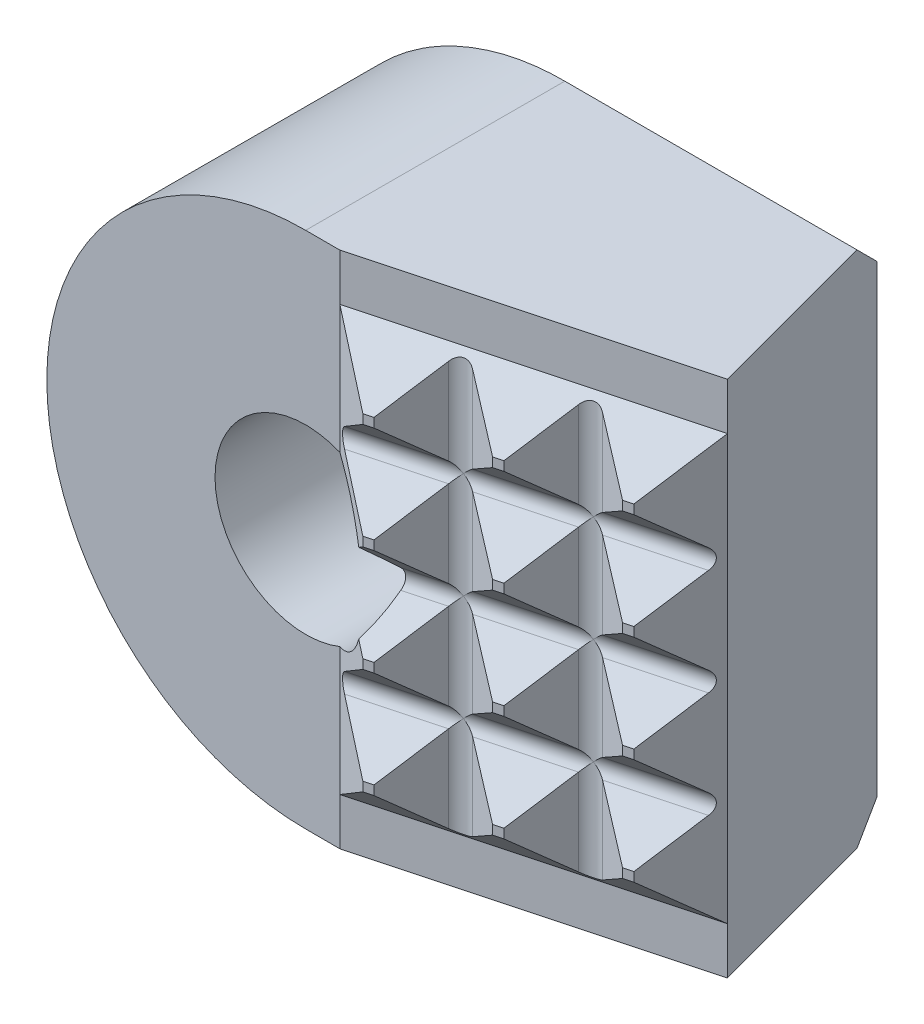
ISO-10303-21;
HEADER;
FILE_DESCRIPTION(('STEP AP214'),'2;1');
FILE_NAME('part.step','',(''),(''),'','','');
FILE_SCHEMA(('AUTOMOTIVE_DESIGN { 1 0 10303 214 1 1 1 1 }'));
ENDSEC;
DATA;
#1=APPLICATION_CONTEXT('core data for automotive mechanical design processes');
#2=APPLICATION_PROTOCOL_DEFINITION('international standard','automotive_design',2000,#1);
#3=PRODUCT_CONTEXT('',#1,'mechanical');
#4=PRODUCT('Part','Part','',(#3));
#5=PRODUCT_RELATED_PRODUCT_CATEGORY('part','',(#4));
#6=PRODUCT_DEFINITION_FORMATION('','',#4);
#7=PRODUCT_DEFINITION_CONTEXT('part definition',#1,'design');
#8=PRODUCT_DEFINITION('design','',#6,#7);
#9=PRODUCT_DEFINITION_SHAPE('','',#8);
#10=(LENGTH_UNIT() NAMED_UNIT(*) SI_UNIT(.MILLI.,.METRE.));
#11=(NAMED_UNIT(*) PLANE_ANGLE_UNIT() SI_UNIT($,.RADIAN.));
#12=(NAMED_UNIT(*) SI_UNIT($,.STERADIAN.) SOLID_ANGLE_UNIT());
#13=UNCERTAINTY_MEASURE_WITH_UNIT(LENGTH_MEASURE(1.E-05),#10,'distance_accuracy_value','');
#14=(GEOMETRIC_REPRESENTATION_CONTEXT(3) GLOBAL_UNCERTAINTY_ASSIGNED_CONTEXT((#13)) GLOBAL_UNIT_ASSIGNED_CONTEXT((#10,
#11,#12)) REPRESENTATION_CONTEXT('',''));
#15=CARTESIAN_POINT('',(0.,0.,0.));
#16=DIRECTION('',(0.,0.,1.));
#17=DIRECTION('',(1.,0.,0.));
#18=AXIS2_PLACEMENT_3D('',#15,#16,#17);
#19=CARTESIAN_POINT('',(-6.7787772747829,0.,10.5128094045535));
#20=DIRECTION('',(0.965925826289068,0.,-0.258819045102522));
#21=DIRECTION('',(0.258819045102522,0.,0.965925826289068));
#22=AXIS2_PLACEMENT_3D('',#19,#20,#21);
#23=CYLINDRICAL_SURFACE('',#22,0.381);
#24=CARTESIAN_POINT('',(2.5,0.,8.42100875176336));
#25=CARTESIAN_POINT('',(2.49999964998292,-0.0212678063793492,8.4210079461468));
#26=CARTESIAN_POINT('',(2.49972579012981,-0.0425483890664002,8.41923256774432));
#27=CARTESIAN_POINT('',(2.49865928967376,-0.084520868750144,8.41217169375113));
#28=CARTESIAN_POINT('',(2.49786612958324,-0.105212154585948,8.40688268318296));
#29=CARTESIAN_POINT('',(2.49584943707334,-0.145396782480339,8.39293380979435));
#30=CARTESIAN_POINT('',(2.494626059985,-0.164890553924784,8.38427516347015));
#31=CARTESIAN_POINT('',(2.49188549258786,-0.20212788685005,8.36382162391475));
#32=CARTESIAN_POINT('',(2.49036836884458,-0.219871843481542,8.35202744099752));
#33=CARTESIAN_POINT('',(2.48721046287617,-0.253106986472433,8.32563315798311));
#34=CARTESIAN_POINT('',(2.48556973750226,-0.268599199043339,8.31103434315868));
#35=CARTESIAN_POINT('',(2.48234678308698,-0.296914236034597,8.27943938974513));
#36=CARTESIAN_POINT('',(2.48076455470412,-0.309737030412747,8.26244322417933));
#37=CARTESIAN_POINT('',(2.47782808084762,-0.332414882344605,8.22648554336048));
#38=CARTESIAN_POINT('',(2.47647454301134,-0.342260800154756,8.20751821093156));
#39=CARTESIAN_POINT('',(2.47414620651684,-0.358705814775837,8.1682049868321));
#40=CARTESIAN_POINT('',(2.47317143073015,-0.36530471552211,8.14785901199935));
#41=CARTESIAN_POINT('',(2.47168628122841,-0.375223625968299,8.10600551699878));
#42=CARTESIAN_POINT('',(2.47118401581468,-0.378486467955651,8.08448419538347));
#43=CARTESIAN_POINT('',(2.47071686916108,-0.381523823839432,8.04119224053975));
#44=CARTESIAN_POINT('',(2.47075208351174,-0.381297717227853,8.0194215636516));
#45=CARTESIAN_POINT('',(2.47135631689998,-0.377361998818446,7.97543935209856));
#46=CARTESIAN_POINT('',(2.47194391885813,-0.373531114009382,7.95323894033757));
#47=CARTESIAN_POINT('',(2.47360592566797,-0.362360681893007,7.90975635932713));
#48=CARTESIAN_POINT('',(2.47468044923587,-0.355020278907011,7.88847441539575));
#49=CARTESIAN_POINT('',(2.47723845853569,-0.336716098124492,7.84666976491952));
#50=CARTESIAN_POINT('',(2.47873478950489,-0.325635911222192,7.82619868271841));
#51=CARTESIAN_POINT('',(2.48194425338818,-0.300194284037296,7.78742021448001));
#52=CARTESIAN_POINT('',(2.48365741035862,-0.285832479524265,7.76911306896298));
#53=CARTESIAN_POINT('',(2.48709314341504,-0.254203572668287,7.73530524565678));
#54=CARTESIAN_POINT('',(2.48881567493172,-0.236945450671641,7.71979619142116));
#55=CARTESIAN_POINT('',(2.49206270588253,-0.199919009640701,7.69210595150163));
#56=CARTESIAN_POINT('',(2.49358728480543,-0.180151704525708,7.67992342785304));
#57=CARTESIAN_POINT('',(2.49616062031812,-0.139875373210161,7.66002514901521));
#58=CARTESIAN_POINT('',(2.49723182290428,-0.119475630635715,7.65209153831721));
#59=CARTESIAN_POINT('',(2.49888427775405,-0.0775622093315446,7.64003566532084));
#60=CARTESIAN_POINT('',(2.49946580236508,-0.0560491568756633,7.63591128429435));
#61=CARTESIAN_POINT('',(2.50004103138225,-0.0141916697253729,7.63183455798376));
#62=CARTESIAN_POINT('',(2.50007402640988,0.00612544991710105,7.63160333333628));
#63=CARTESIAN_POINT('',(2.49964909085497,0.0464934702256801,7.63461056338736));
#64=CARTESIAN_POINT('',(2.49919123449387,0.0665444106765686,7.63784849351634));
#65=CARTESIAN_POINT('',(2.49785333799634,0.105344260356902,7.64753275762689));
#66=CARTESIAN_POINT('',(2.49698324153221,0.12411250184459,7.65390365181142));
#67=CARTESIAN_POINT('',(2.49491729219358,0.160367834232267,7.66956154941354));
#68=CARTESIAN_POINT('',(2.49372138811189,0.177854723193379,7.67884901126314));
#69=CARTESIAN_POINT('',(2.4910673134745,0.211865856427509,7.70046544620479));
#70=CARTESIAN_POINT('',(2.48960017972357,0.228317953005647,7.71290658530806));
#71=CARTESIAN_POINT('',(2.48658842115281,0.259069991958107,7.74020305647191));
#72=CARTESIAN_POINT('',(2.4850437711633,0.273369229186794,7.75505917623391));
#73=CARTESIAN_POINT('',(2.48191525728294,0.300493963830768,7.78792102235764));
#74=CARTESIAN_POINT('',(2.48033661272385,0.313138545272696,7.80607669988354));
#75=CARTESIAN_POINT('',(2.47742687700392,0.335383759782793,7.84418583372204));
#76=CARTESIAN_POINT('',(2.47609586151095,0.344983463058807,7.86413983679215));
#77=CARTESIAN_POINT('',(2.47376613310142,0.361321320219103,7.90637404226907));
#78=CARTESIAN_POINT('',(2.47278752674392,0.367891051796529,7.92872078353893));
#79=CARTESIAN_POINT('',(2.47138144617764,0.377221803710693,7.97421525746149));
#80=CARTESIAN_POINT('',(2.47095398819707,0.379982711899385,7.99736301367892));
#81=CARTESIAN_POINT('',(2.4707126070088,0.381549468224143,8.04376545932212));
#82=CARTESIAN_POINT('',(2.47089777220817,0.380361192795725,8.06701993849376));
#83=CARTESIAN_POINT('',(2.47187044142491,0.373987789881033,8.1129627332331));
#84=CARTESIAN_POINT('',(2.47265781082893,0.368803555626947,8.13565117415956));
#85=CARTESIAN_POINT('',(2.47470856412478,0.354775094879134,8.17892821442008));
#86=CARTESIAN_POINT('',(2.47595352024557,0.346071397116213,8.19956323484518));
#87=CARTESIAN_POINT('',(2.478777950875,0.325222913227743,8.23898903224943));
#88=CARTESIAN_POINT('',(2.48035735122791,0.31307888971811,8.25778021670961));
#89=CARTESIAN_POINT('',(2.4836064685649,0.286140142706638,8.29234204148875));
#90=CARTESIAN_POINT('',(2.48527144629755,0.271446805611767,8.30819225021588));
#91=CARTESIAN_POINT('',(2.48854700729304,0.239561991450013,8.33715589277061));
#92=CARTESIAN_POINT('',(2.49015758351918,0.222370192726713,8.35026897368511));
#93=CARTESIAN_POINT('',(2.4931193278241,0.186226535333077,8.37322782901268));
#94=CARTESIAN_POINT('',(2.49447359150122,0.167300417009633,8.38311380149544));
#95=CARTESIAN_POINT('',(2.49679545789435,0.1280523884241,8.39957382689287));
#96=CARTESIAN_POINT('',(2.49776345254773,0.107731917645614,8.40615123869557));
#97=CARTESIAN_POINT('',(2.49898165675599,0.0727657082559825,8.41431790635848));
#98=CARTESIAN_POINT('',(2.49936165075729,0.0583314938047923,8.41682369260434));
#99=CARTESIAN_POINT('',(2.49987094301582,0.0292668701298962,8.42016939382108));
#100=CARTESIAN_POINT('',(2.50000024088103,0.0146364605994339,8.42100930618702));
#101=CARTESIAN_POINT('',(2.5,0.,8.42100875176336));
#102=B_SPLINE_CURVE_WITH_KNOTS('',3,(#24,#25,#26,#27,#28,#29,#30,#31,#32,#33,#34,#35,#36,#37,
#38,#39,#40,#41,#42,#43,#44,#45,#46,#47,#48,#49,#50,#51,#52,#53,#54,#55,#56,#57,#58,#59,#60,#61,
#62,#63,#64,#65,#66,#67,#68,#69,#70,#71,#72,#73,#74,#75,#76,#77,#78,#79,#80,#81,#82,#83,#84,#85,
#86,#87,#88,#89,#90,#91,#92,#93,#94,#95,#96,#97,#98,#99,#100,#101),.UNSPECIFIED.,.T.,.F.,(4,2,2,
2,2,2,2,2,2,2,2,2,2,2,2,2,2,2,2,2,2,2,2,2,2,2,2,2,2,2,2,2,2,2,2,2,2,2,4),(0.,0.063750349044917,
0.127564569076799,0.19135577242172,0.255132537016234,0.31888014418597,0.382628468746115,
0.446570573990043,0.510516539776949,0.575540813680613,0.640576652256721,0.707881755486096,
0.77520327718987,0.844850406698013,0.914505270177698,0.983948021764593,1.05336280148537,
1.11875686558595,1.18411453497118,1.24476876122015,1.30541381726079,1.36466523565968,
1.42392597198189,1.48569680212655,1.54748782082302,1.61373966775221,1.68001172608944,
1.74962070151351,1.81923172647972,1.88873921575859,1.95823117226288,2.02518611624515,
2.09212622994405,2.15684397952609,2.22157006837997,2.28545606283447,2.34927706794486,
2.39314985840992,2.43702271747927),.UNSPECIFIED.);
#103=CARTESIAN_POINT('',(2.48544151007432,-0.269407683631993,7.7515581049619));
#104=VERTEX_POINT('',#103);
#105=CARTESIAN_POINT('',(2.48544151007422,0.269407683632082,7.751558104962));
#106=VERTEX_POINT('',#105);
#107=EDGE_CURVE('E29',#104,#106,#102,.T.);
#108=ORIENTED_EDGE('',*,*,#107,.F.);
#109=DIRECTION('',(0.965925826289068,0.,-0.258819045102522));
#110=VECTOR('',#109,1.);
#111=CARTESIAN_POINT('',(-6.84850511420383,-0.269407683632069,10.2525815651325));
#112=LINE('',#111,#110);
#113=CARTESIAN_POINT('',(3.5240670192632,-0.269407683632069,7.47325923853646));
#114=VERTEX_POINT('',#113);
#115=EDGE_CURVE('E1276',#104,#114,#112,.T.);
#116=ORIENTED_EDGE('',*,*,#115,.T.);
#117=CARTESIAN_POINT('',(3.85402269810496,0.,7.66375923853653));
#118=DIRECTION('',(-0.683012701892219,0.707106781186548,0.18301270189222));
#119=DIRECTION('',(0.683012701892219,0.707106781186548,-0.18301270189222));
#120=AXIS2_PLACEMENT_3D('',#117,#118,#119);
#121=ELLIPSE('',#120,0.538815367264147,0.381);
#122=CARTESIAN_POINT('',(3.7554126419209,0.,7.2957414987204));
#123=VERTEX_POINT('',#122);
#124=EDGE_CURVE('E872',#123,#114,#121,.T.);
#125=ORIENTED_EDGE('',*,*,#124,.F.);
#126=CARTESIAN_POINT('',(3.85402269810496,0.,7.66375923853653));
#127=DIRECTION('',(0.683012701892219,0.707106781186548,-0.18301270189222));
#128=DIRECTION('',(-0.683012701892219,0.707106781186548,0.18301270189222));
#129=AXIS2_PLACEMENT_3D('',#126,#127,#128);
#130=ELLIPSE('',#129,0.538815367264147,0.381);
#131=CARTESIAN_POINT('',(3.5240670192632,0.269407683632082,7.47325923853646));
#132=VERTEX_POINT('',#131);
#133=EDGE_CURVE('E878',#132,#123,#130,.F.);
#134=ORIENTED_EDGE('',*,*,#133,.F.);
#135=DIRECTION('',(0.965925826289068,0.,-0.258819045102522));
#136=VECTOR('',#135,1.);
#137=CARTESIAN_POINT('',(-6.84850511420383,0.269407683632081,10.2525815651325));
#138=LINE('',#137,#136);
#139=EDGE_CURVE('E904',#106,#132,#138,.T.);
#140=ORIENTED_EDGE('',*,*,#139,.F.);
#141=EDGE_LOOP('',(#108,#116,#125,#134,#140));
#142=FACE_BOUND('',#141,.T.);
#143=ADVANCED_FACE('F14',(#142),#23,.F.);
#144=CARTESIAN_POINT('',(2.53057310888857,-7.1374,8.84109455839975));
#145=DIRECTION('',(0.515287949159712,0.,-0.857017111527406));
#146=DIRECTION('',(0.857017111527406,0.,0.515287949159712));
#147=AXIS2_PLACEMENT_3D('',#144,#145,#146);
#148=PLANE('',#147);
#149=DIRECTION('',(0.695649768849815,-0.584060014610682,0.418264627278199));
#150=VECTOR('',#149,1.);
#151=CARTESIAN_POINT('',(4.88870472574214,-3.31336177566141,10.2589388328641));
#152=LINE('',#151,#150);
#153=CARTESIAN_POINT('',(2.24716685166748,-1.09555517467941,8.67069442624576));
#154=VERTEX_POINT('',#153);
#155=CARTESIAN_POINT('',(2.53057310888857,-1.33350000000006,8.84109455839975));
#156=VERTEX_POINT('',#155);
#157=EDGE_CURVE('E833',#154,#156,#152,.T.);
#158=ORIENTED_EDGE('',*,*,#157,.F.);
#159=CARTESIAN_POINT('',(0.,0.,7.31956854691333));
#160=DIRECTION('',(0.515287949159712,0.,-0.857017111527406));
#161=DIRECTION('',(-0.857017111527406,0.,-0.515287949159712));
#162=AXIS2_PLACEMENT_3D('',#159,#160,#161);
#163=ELLIPSE('',#162,2.9170946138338,2.5);
#164=CARTESIAN_POINT('',(0.94229631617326,-2.31561604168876,7.88613125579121));
#165=VERTEX_POINT('',#164);
#166=EDGE_CURVE('E835',#154,#165,#163,.T.);
#167=ORIENTED_EDGE('',*,*,#166,.T.);
#168=DIRECTION('',(0.,1.,0.));
#169=VECTOR('',#168,1.);
#170=CARTESIAN_POINT('',(0.94229631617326,-7.1374,7.88613125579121));
#171=LINE('',#170,#169);
#172=CARTESIAN_POINT('',(0.94229631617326,-5.84199999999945,7.88613125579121));
#173=VERTEX_POINT('',#172);
#174=EDGE_CURVE('E949',#173,#165,#171,.T.);
#175=ORIENTED_EDGE('',*,*,#174,.F.);
#176=DIRECTION('',(-0.695649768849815,-0.584060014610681,-0.418264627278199));
#177=VECTOR('',#176,1.);
#178=CARTESIAN_POINT('',(1.46244784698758,-5.40528640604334,8.19887625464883));
#179=LINE('',#178,#177);
#180=CARTESIAN_POINT('',(2.53057310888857,-4.50849999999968,8.84109455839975));
#181=VERTEX_POINT('',#180);
#182=EDGE_CURVE('E443',#181,#173,#179,.T.);
#183=ORIENTED_EDGE('',*,*,#182,.F.);
#184=DIRECTION('',(0.,1.,0.));
#185=VECTOR('',#184,1.);
#186=CARTESIAN_POINT('',(2.53057310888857,-7.1374,8.84109455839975));
#187=LINE('',#186,#185);
#188=CARTESIAN_POINT('',(2.53057310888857,-4.25449999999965,8.84109455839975));
#189=VERTEX_POINT('',#188);
#190=EDGE_CURVE('E943',#181,#189,#187,.T.);
#191=ORIENTED_EDGE('',*,*,#190,.T.);
#192=DIRECTION('',(0.695649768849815,-0.584060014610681,0.418264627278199));
#193=VECTOR('',#192,1.);
#194=CARTESIAN_POINT('',(3.70189887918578,-5.23793243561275,9.54536293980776));
#195=LINE('',#194,#193);
#196=CARTESIAN_POINT('',(1.26317668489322,-3.19040768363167,8.07906297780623));
#197=VERTEX_POINT('',#196);
#198=EDGE_CURVE('E1285',#197,#189,#195,.T.);
#199=ORIENTED_EDGE('',*,*,#198,.F.);
#200=CARTESIAN_POINT('',(1.58405705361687,-2.9209999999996,8.27199469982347));
#201=DIRECTION('',(0.515287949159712,0.,-0.857017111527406));
#202=DIRECTION('',(0.857017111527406,0.,0.515287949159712));
#203=AXIS2_PLACEMENT_3D('',#200,#201,#202);
#204=ELLIPSE('',#203,0.529503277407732,0.381);
#205=CARTESIAN_POINT('',(1.26317668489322,-2.65159231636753,8.07906297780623));
#206=VERTEX_POINT('',#205);
#207=EDGE_CURVE('E1283',#197,#206,#204,.T.);
#208=ORIENTED_EDGE('',*,*,#207,.T.);
#209=DIRECTION('',(-0.695649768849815,-0.584060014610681,-0.418264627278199));
#210=VECTOR('',#209,1.);
#211=CARTESIAN_POINT('',(0.275642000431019,-3.48071574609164,7.48530036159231));
#212=LINE('',#211,#210);
#213=CARTESIAN_POINT('',(2.53057310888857,-1.58749999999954,8.84109455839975));
#214=VERTEX_POINT('',#213);
#215=EDGE_CURVE('E1862',#214,#206,#212,.T.);
#216=ORIENTED_EDGE('',*,*,#215,.F.);
#217=EDGE_CURVE('E839',#214,#156,#187,.T.);
#218=ORIENTED_EDGE('',*,*,#217,.T.);
#219=EDGE_LOOP('',(#158,#167,#175,#183,#191,#199,#208,#216,#218));
#220=FACE_BOUND('',#219,.T.);
#221=ADVANCED_FACE('F817',(#220),#148,.F.);
#222=CARTESIAN_POINT('',(0.94229631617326,2.31561604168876,7.88613125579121));
#223=VERTEX_POINT('',#222);
#224=CARTESIAN_POINT('',(0.94229631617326,5.84199999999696,7.88613125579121));
#225=VERTEX_POINT('',#224);
#226=EDGE_CURVE('E406',#223,#225,#171,.T.);
#227=ORIENTED_EDGE('',*,*,#226,.F.);
#228=CARTESIAN_POINT('',(0.,0.,7.31956854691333));
#229=DIRECTION('',(0.515287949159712,0.,-0.857017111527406));
#230=DIRECTION('',(-0.857017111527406,0.,-0.515287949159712));
#231=AXIS2_PLACEMENT_3D('',#228,#229,#230);
#232=ELLIPSE('',#231,2.9170946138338,2.5);
#233=CARTESIAN_POINT('',(2.24716685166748,1.09555517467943,8.67069442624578));
#234=VERTEX_POINT('',#233);
#235=EDGE_CURVE('E392',#223,#234,#232,.T.);
#236=ORIENTED_EDGE('',*,*,#235,.T.);
#237=DIRECTION('',(0.695649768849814,0.584060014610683,0.418264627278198));
#238=VECTOR('',#237,1.);
#239=CARTESIAN_POINT('',(-0.91116384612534,-1.55614508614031,6.77172446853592));
#240=LINE('',#239,#238);
#241=CARTESIAN_POINT('',(2.53057310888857,1.33350000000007,8.84109455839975));
#242=VERTEX_POINT('',#241);
#243=EDGE_CURVE('E403',#234,#242,#240,.T.);
#244=ORIENTED_EDGE('',*,*,#243,.T.);
#245=CARTESIAN_POINT('',(2.53057310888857,1.58750000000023,8.84109455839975));
#246=VERTEX_POINT('',#245);
#247=EDGE_CURVE('E946',#242,#246,#187,.T.);
#248=ORIENTED_EDGE('',*,*,#247,.T.);
#249=DIRECTION('',(-0.695649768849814,0.584060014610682,-0.418264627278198));
#250=VECTOR('',#249,1.);
#251=CARTESIAN_POINT('',(6.07551057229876,-1.38879111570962,10.9725147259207));
#252=LINE('',#251,#250);
#253=CARTESIAN_POINT('',(1.26317668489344,2.65159231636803,8.07906297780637));
#254=VERTEX_POINT('',#253);
#255=EDGE_CURVE('E1863',#246,#254,#252,.T.);
#256=ORIENTED_EDGE('',*,*,#255,.T.);
#257=CARTESIAN_POINT('',(1.58405705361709,2.9210000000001,8.2719946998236));
#258=DIRECTION('',(0.515287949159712,0.,-0.857017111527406));
#259=DIRECTION('',(0.857017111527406,0.,0.515287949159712));
#260=AXIS2_PLACEMENT_3D('',#257,#258,#259);
#261=ELLIPSE('',#260,0.529503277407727,0.381);
#262=CARTESIAN_POINT('',(1.26317668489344,3.19040768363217,8.07906297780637));
#263=VERTEX_POINT('',#262);
#264=EDGE_CURVE('E22',#263,#254,#261,.F.);
#265=ORIENTED_EDGE('',*,*,#264,.F.);
#266=DIRECTION('',(0.695649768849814,0.584060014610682,0.418264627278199));
#267=VECTOR('',#266,1.);
#268=CARTESIAN_POINT('',(-2.09796969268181,0.368425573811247,6.05814857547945));
#269=LINE('',#268,#267);
#270=CARTESIAN_POINT('',(2.53057310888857,4.2545,8.84109455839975));
#271=VERTEX_POINT('',#270);
#272=EDGE_CURVE('E9',#263,#271,#269,.T.);
#273=ORIENTED_EDGE('',*,*,#272,.T.);
#274=CARTESIAN_POINT('',(2.53057310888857,4.5085,8.84109455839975));
#275=VERTEX_POINT('',#274);
#276=EDGE_CURVE('E944',#271,#275,#187,.T.);
#277=ORIENTED_EDGE('',*,*,#276,.T.);
#278=DIRECTION('',(-0.695649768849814,0.584060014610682,-0.418264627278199));
#279=VECTOR('',#278,1.);
#280=CARTESIAN_POINT('',(7.26231641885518,0.535779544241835,11.6860906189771));
#281=LINE('',#280,#279);
#282=EDGE_CURVE('E468',#275,#225,#281,.T.);
#283=ORIENTED_EDGE('',*,*,#282,.T.);
#284=EDGE_LOOP('',(#227,#236,#244,#248,#256,#265,#273,#277,#283));
#285=FACE_BOUND('',#284,.T.);
#286=ADVANCED_FACE('F401',(#285),#148,.F.);
#287=CARTESIAN_POINT('',(-7.13739195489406,-7.1374,7.87400000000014));
#288=DIRECTION('',(-0.00150144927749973,0.,0.999998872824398));
#289=DIRECTION('',(-0.999998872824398,0.,-0.00150144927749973));
#290=AXIS2_PLACEMENT_3D('',#287,#288,#289);
#291=PLANE('',#290);
#292=CARTESIAN_POINT('',(0.,0.,7.88471644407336));
#293=DIRECTION('',(-0.00150144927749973,0.,0.999998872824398));
#294=DIRECTION('',(-0.999998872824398,0.,-0.00150144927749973));
#295=AXIS2_PLACEMENT_3D('',#292,#293,#294);
#296=ELLIPSE('',#295,2.50000281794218,2.5);
#297=EDGE_CURVE('E1215',#223,#165,#296,.T.);
#298=ORIENTED_EDGE('',*,*,#297,.F.);
#299=ORIENTED_EDGE('',*,*,#226,.T.);
#300=CARTESIAN_POINT('',(0.94229631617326,7.1374,7.88613125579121));
#301=VERTEX_POINT('',#300);
#302=EDGE_CURVE('E950',#225,#301,#171,.T.);
#303=ORIENTED_EDGE('',*,*,#302,.T.);
#304=DIRECTION('',(0.999998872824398,0.,0.00150144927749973));
#305=VECTOR('',#304,1.);
#306=CARTESIAN_POINT('',(-7.13739195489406,7.1374,7.87400000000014));
#307=LINE('',#306,#305);
#308=CARTESIAN_POINT('',(0.,7.1374,7.88471644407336));
#309=VERTEX_POINT('',#308);
#310=EDGE_CURVE('E717',#309,#301,#307,.T.);
#311=ORIENTED_EDGE('',*,*,#310,.F.);
#312=CARTESIAN_POINT('',(0.,0.,7.8847164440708));
#313=DIRECTION('',(0.00150144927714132,0.,-0.999998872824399));
#314=DIRECTION('',(0.999998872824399,0.,0.00150144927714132));
#315=AXIS2_PLACEMENT_3D('',#312,#313,#314);
#316=CIRCLE('',#315,7.1374);
#317=CARTESIAN_POINT('',(0.,-7.1374,7.8847164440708));
#318=VERTEX_POINT('',#317);
#319=EDGE_CURVE('E707',#318,#309,#316,.T.);
#320=ORIENTED_EDGE('',*,*,#319,.F.);
#321=DIRECTION('',(0.999998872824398,0.,0.00150144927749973));
#322=VECTOR('',#321,1.);
#323=CARTESIAN_POINT('',(-7.13739195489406,-7.1374,7.87400000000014));
#324=LINE('',#323,#322);
#325=CARTESIAN_POINT('',(0.94229631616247,-7.1374,7.8861312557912));
#326=VERTEX_POINT('',#325);
#327=EDGE_CURVE('E959',#318,#326,#324,.T.);
#328=ORIENTED_EDGE('',*,*,#327,.T.);
#329=EDGE_CURVE('E947',#326,#173,#171,.T.);
#330=ORIENTED_EDGE('',*,*,#329,.T.);
#331=ORIENTED_EDGE('',*,*,#174,.T.);
#332=EDGE_LOOP('',(#298,#299,#303,#311,#320,#328,#330,#331));
#333=FACE_BOUND('',#332,.T.);
#334=ADVANCED_FACE('F16',(#333),#291,.T.);
#335=CARTESIAN_POINT('',(-6.84850511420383,-0.26940768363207,10.2525815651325));
#336=DIRECTION('',(0.18301270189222,0.707106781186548,0.683012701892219));
#337=DIRECTION('',(0.,-0.694746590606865,0.719254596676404));
#338=AXIS2_PLACEMENT_3D('',#335,#336,#337);
#339=PLANE('',#338);
#340=CARTESIAN_POINT('',(0.,0.,8.13861879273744));
#341=DIRECTION('',(0.18301270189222,0.707106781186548,0.683012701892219));
#342=DIRECTION('',(0.171137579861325,0.661224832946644,-0.730406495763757));
#343=AXIS2_PLACEMENT_3D('',#340,#341,#342);
#344=ELLIPSE('',#343,3.66025403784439,2.5);
#345=EDGE_CURVE('E1219',#154,#104,#344,.T.);
#346=ORIENTED_EDGE('',*,*,#345,.F.);
#347=ORIENTED_EDGE('',*,*,#157,.T.);
#348=DIRECTION('',(0.965925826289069,0.,-0.258819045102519));
#349=VECTOR('',#348,1.);
#350=CARTESIAN_POINT('',(2.77164012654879,-1.33350000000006,8.77650084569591));
#351=LINE('',#350,#349);
#352=CARTESIAN_POINT('',(2.77164012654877,-1.33350000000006,8.77650084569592));
#353=VERTEX_POINT('',#352);
#354=EDGE_CURVE('E843',#156,#353,#351,.T.);
#355=ORIENTED_EDGE('',*,*,#354,.T.);
#356=DIRECTION('',(0.408248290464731,0.577350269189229,-0.70710678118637));
#357=VECTOR('',#356,1.);
#358=CARTESIAN_POINT('',(1.905265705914,-2.55873845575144,10.2771053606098));
#359=LINE('',#358,#357);
#360=EDGE_CURVE('E846',#353,#114,#359,.T.);
#361=ORIENTED_EDGE('',*,*,#360,.T.);
#362=ORIENTED_EDGE('',*,*,#115,.F.);
#363=EDGE_LOOP('',(#346,#347,#355,#361,#362));
#364=FACE_BOUND('',#363,.T.);
#365=ADVANCED_FACE('F1261',(#364),#339,.T.);
#366=CARTESIAN_POINT('',(-6.84850511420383,0.269407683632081,10.2525815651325));
#367=DIRECTION('',(-0.183012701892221,0.707106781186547,-0.68301270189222));
#368=DIRECTION('',(0.,0.694746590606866,0.719254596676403));
#369=AXIS2_PLACEMENT_3D('',#366,#367,#368);
#370=PLANE('',#369);
#371=ORIENTED_EDGE('',*,*,#243,.F.);
#372=CARTESIAN_POINT('',(0.,0.,8.13861879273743));
#373=DIRECTION('',(-0.183012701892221,0.707106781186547,-0.68301270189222));
#374=DIRECTION('',(0.171137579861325,-0.661224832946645,-0.730406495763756));
#375=AXIS2_PLACEMENT_3D('',#372,#373,#374);
#376=ELLIPSE('',#375,3.66025403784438,2.5);
#377=EDGE_CURVE('E388',#234,#106,#376,.T.);
#378=ORIENTED_EDGE('',*,*,#377,.T.);
#379=ORIENTED_EDGE('',*,*,#139,.T.);
#380=DIRECTION('',(0.408248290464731,-0.57735026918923,-0.70710678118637));
#381=VECTOR('',#380,1.);
#382=CARTESIAN_POINT('',(5.26986833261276,-2.19952821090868,4.44944266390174));
#383=LINE('',#382,#381);
#384=CARTESIAN_POINT('',(2.77164012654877,1.33350000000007,8.77650084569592));
#385=VERTEX_POINT('',#384);
#386=EDGE_CURVE('E414',#385,#132,#383,.T.);
#387=ORIENTED_EDGE('',*,*,#386,.F.);
#388=DIRECTION('',(0.965925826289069,0.,-0.258819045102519));
#389=VECTOR('',#388,1.);
#390=CARTESIAN_POINT('',(2.77164012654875,1.33350000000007,8.77650084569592));
#391=LINE('',#390,#389);
#392=EDGE_CURVE('E410',#242,#385,#391,.T.);
#393=ORIENTED_EDGE('',*,*,#392,.F.);
#394=EDGE_LOOP('',(#371,#378,#379,#387,#393));
#395=FACE_BOUND('',#394,.T.);
#396=ADVANCED_FACE('F408',(#395),#370,.F.);
#397=CARTESIAN_POINT('',(3.85402269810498,-7.1374,7.66375923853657));
#398=DIRECTION('',(0.,-1.,0.));
#399=DIRECTION('',(0.,0.,-1.));
#400=AXIS2_PLACEMENT_3D('',#397,#398,#399);
#401=PLANE('',#400);
#402=DIRECTION('',(0.258819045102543,0.,0.965925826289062));
#403=VECTOR('',#402,1.);
#404=CARTESIAN_POINT('',(7.84860804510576,-7.1374,1.38793976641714E-13));
#405=LINE('',#404,#403);
#406=CARTESIAN_POINT('',(8.05278532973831,-7.1374,0.762000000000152));
#407=VERTEX_POINT('',#406);
#408=CARTESIAN_POINT('',(9.35750569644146,-7.1374,5.63128269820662));
#409=VERTEX_POINT('',#408);
#410=EDGE_CURVE('E954',#407,#409,#405,.T.);
#411=ORIENTED_EDGE('',*,*,#410,.T.);
#412=DIRECTION('',(-0.965925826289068,0.,0.258819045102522));
#413=VECTOR('',#412,1.);
#414=CARTESIAN_POINT('',(3.71456701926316,-7.1374,7.1433035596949));
#415=LINE('',#414,#413);
#416=EDGE_CURVE('E440',#409,#326,#415,.T.);
#417=ORIENTED_EDGE('',*,*,#416,.T.);
#418=ORIENTED_EDGE('',*,*,#327,.F.);
#419=DIRECTION('',(-0.00150144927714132,0.,0.999998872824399));
#420=VECTOR('',#419,1.);
#421=CARTESIAN_POINT('',(0.0118595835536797,-7.1374,-0.0140320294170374));
#422=LINE('',#421,#420);
#423=CARTESIAN_POINT('',(0.0106944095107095,-7.1374,0.762000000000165));
#424=VERTEX_POINT('',#423);
#425=EDGE_CURVE('E714',#424,#318,#422,.T.);
#426=ORIENTED_EDGE('',*,*,#425,.F.);
#427=DIRECTION('',(1.,0.,0.));
#428=VECTOR('',#427,1.);
#429=CARTESIAN_POINT('',(7.84860804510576,-7.1374,0.762000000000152));
#430=LINE('',#429,#428);
#431=EDGE_CURVE('E724',#424,#407,#430,.T.);
#432=ORIENTED_EDGE('',*,*,#431,.T.);
#433=EDGE_LOOP('',(#411,#417,#418,#426,#432));
#434=FACE_BOUND('',#433,.T.);
#435=ADVANCED_FACE('F754',(#434),#401,.T.);
#436=CARTESIAN_POINT('',(3.85402269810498,7.1374,7.66375923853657));
#437=DIRECTION('',(0.,-1.,0.));
#438=DIRECTION('',(0.,0.,-1.));
#439=AXIS2_PLACEMENT_3D('',#436,#437,#438);
#440=PLANE('',#439);
#441=DIRECTION('',(-0.965925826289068,0.,0.258819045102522));
#442=VECTOR('',#441,1.);
#443=CARTESIAN_POINT('',(3.71456701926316,7.1374,7.1433035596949));
#444=LINE('',#443,#442);
#445=CARTESIAN_POINT('',(9.35750569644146,7.1374,5.63128269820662));
#446=VERTEX_POINT('',#445);
#447=EDGE_CURVE('E498',#446,#301,#444,.T.);
#448=ORIENTED_EDGE('',*,*,#447,.F.);
#449=DIRECTION('',(0.258819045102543,0.,0.965925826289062));
#450=VECTOR('',#449,1.);
#451=CARTESIAN_POINT('',(7.84860804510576,7.1374,1.39338158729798E-13));
#452=LINE('',#451,#450);
#453=CARTESIAN_POINT('',(8.05278532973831,7.1374,0.762000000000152));
#454=VERTEX_POINT('',#453);
#455=EDGE_CURVE('E964',#454,#446,#452,.T.);
#456=ORIENTED_EDGE('',*,*,#455,.F.);
#457=DIRECTION('',(-1.,0.,0.));
#458=VECTOR('',#457,1.);
#459=CARTESIAN_POINT('',(3.85402269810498,7.1374,0.762000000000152));
#460=LINE('',#459,#458);
#461=CARTESIAN_POINT('',(0.0106944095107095,7.1374,0.762000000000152));
#462=VERTEX_POINT('',#461);
#463=EDGE_CURVE('E1311',#454,#462,#460,.T.);
#464=ORIENTED_EDGE('',*,*,#463,.T.);
#465=DIRECTION('',(-0.00150144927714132,0.,0.999998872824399));
#466=VECTOR('',#465,1.);
#467=CARTESIAN_POINT('',(0.0118595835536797,7.1374,-0.0140320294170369));
#468=LINE('',#467,#466);
#469=EDGE_CURVE('E728',#309,#462,#468,.F.);
#470=ORIENTED_EDGE('',*,*,#469,.F.);
#471=ORIENTED_EDGE('',*,*,#310,.T.);
#472=EDGE_LOOP('',(#448,#456,#464,#470,#471));
#473=FACE_BOUND('',#472,.T.);
#474=ADVANCED_FACE('F764',(#473),#440,.F.);
#475=CARTESIAN_POINT('',(9.35750569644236,-7.1374,5.63128269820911));
#476=DIRECTION('',(-0.866025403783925,0.,-0.50000000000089));
#477=DIRECTION('',(0.50000000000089,0.,-0.866025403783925));
#478=AXIS2_PLACEMENT_3D('',#475,#476,#477);
#479=PLANE('',#478);
#480=DIRECTION('',(0.,1.,0.));
#481=VECTOR('',#480,1.);
#482=CARTESIAN_POINT('',(9.35750569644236,-7.1374,5.63128269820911));
#483=LINE('',#482,#481);
#484=CARTESIAN_POINT('',(9.35750569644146,-5.84199999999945,5.63128269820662));
#485=VERTEX_POINT('',#484);
#486=CARTESIAN_POINT('',(9.35750569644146,5.84199999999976,5.63128269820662));
#487=VERTEX_POINT('',#486);
#488=EDGE_CURVE('E973',#485,#487,#483,.T.);
#489=ORIENTED_EDGE('',*,*,#488,.T.);
#490=DIRECTION('',(-0.408248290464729,-0.57735026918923,0.707106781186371));
#491=VECTOR('',#490,1.);
#492=CARTESIAN_POINT('',(6.29823177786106,1.51553333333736,10.9301005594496));
#493=LINE('',#492,#491);
#494=CARTESIAN_POINT('',(8.41457880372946,4.5085,7.264479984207));
#495=VERTEX_POINT('',#494);
#496=EDGE_CURVE('E495',#487,#495,#493,.T.);
#497=ORIENTED_EDGE('',*,*,#496,.T.);
#498=DIRECTION('',(0.,1.,0.));
#499=VECTOR('',#498,1.);
#500=CARTESIAN_POINT('',(8.41457880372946,-7.1374,7.264479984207));
#501=LINE('',#500,#499);
#502=CARTESIAN_POINT('',(8.41457880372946,4.2545,7.264479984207));
#503=VERTEX_POINT('',#502);
#504=EDGE_CURVE('E974',#503,#495,#501,.T.);
#505=ORIENTED_EDGE('',*,*,#504,.F.);
#506=DIRECTION('',(0.408248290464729,-0.57735026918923,-0.707106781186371));
#507=VECTOR('',#506,1.);
#508=CARTESIAN_POINT('',(11.7282933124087,-0.431799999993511,1.52495809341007));
#509=LINE('',#508,#507);
#510=CARTESIAN_POINT('',(9.16700569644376,3.19040768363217,5.96123837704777));
#511=VERTEX_POINT('',#510);
#512=EDGE_CURVE('E624',#503,#511,#509,.T.);
#513=ORIENTED_EDGE('',*,*,#512,.T.);
#514=CARTESIAN_POINT('',(8.97650569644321,2.9210000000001,6.29119405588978));
#515=DIRECTION('',(-0.866025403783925,0.,-0.50000000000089));
#516=DIRECTION('',(0.50000000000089,0.,-0.866025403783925));
#517=AXIS2_PLACEMENT_3D('',#514,#515,#516);
#518=ELLIPSE('',#517,0.538815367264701,0.381);
#519=CARTESIAN_POINT('',(9.16700569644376,2.65159231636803,5.96123837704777));
#520=VERTEX_POINT('',#519);
#521=EDGE_CURVE('E601',#520,#511,#518,.F.);
#522=ORIENTED_EDGE('',*,*,#521,.F.);
#523=DIRECTION('',(-0.408248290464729,-0.57735026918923,0.70710678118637));
#524=VECTOR('',#523,1.);
#525=CARTESIAN_POINT('',(6.9867180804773,-0.431799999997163,9.73760730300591));
#526=LINE('',#525,#524);
#527=CARTESIAN_POINT('',(8.41457880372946,1.58750000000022,7.264479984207));
#528=VERTEX_POINT('',#527);
#529=EDGE_CURVE('E574',#520,#528,#526,.T.);
#530=ORIENTED_EDGE('',*,*,#529,.T.);
#531=CARTESIAN_POINT('',(8.41457880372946,1.33350000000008,7.264479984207));
#532=VERTEX_POINT('',#531);
#533=EDGE_CURVE('E977',#532,#528,#501,.T.);
#534=ORIENTED_EDGE('',*,*,#533,.F.);
#535=DIRECTION('',(0.408248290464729,-0.577350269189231,-0.70710678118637));
#536=VECTOR('',#535,1.);
#537=CARTESIAN_POINT('',(11.0398070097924,-2.37913333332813,2.71745134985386));
#538=LINE('',#537,#536);
#539=CARTESIAN_POINT('',(9.16700569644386,0.269407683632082,5.96123837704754));
#540=VERTEX_POINT('',#539);
#541=EDGE_CURVE('E437',#532,#540,#538,.T.);
#542=ORIENTED_EDGE('',*,*,#541,.T.);
#543=CARTESIAN_POINT('',(8.97650569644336,0.,6.29119405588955));
#544=DIRECTION('',(-0.866025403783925,0.,-0.50000000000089));
#545=DIRECTION('',(0.50000000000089,0.,-0.866025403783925));
#546=AXIS2_PLACEMENT_3D('',#543,#544,#545);
#547=ELLIPSE('',#546,0.538815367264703,0.381);
#548=CARTESIAN_POINT('',(9.16700569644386,-0.269407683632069,5.96123837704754));
#549=VERTEX_POINT('',#548);
#550=EDGE_CURVE('E412',#549,#540,#547,.F.);
#551=ORIENTED_EDGE('',*,*,#550,.F.);
#552=DIRECTION('',(0.408248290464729,0.57735026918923,-0.707106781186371));
#553=VECTOR('',#552,1.);
#554=CARTESIAN_POINT('',(7.67520438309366,-2.37913333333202,8.54511404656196));
#555=LINE('',#554,#553);
#556=CARTESIAN_POINT('',(8.41457880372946,-1.33350000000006,7.264479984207));
#557=VERTEX_POINT('',#556);
#558=EDGE_CURVE('E867',#557,#549,#555,.T.);
#559=ORIENTED_EDGE('',*,*,#558,.F.);
#560=CARTESIAN_POINT('',(8.41457880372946,-1.58749999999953,7.264479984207));
#561=VERTEX_POINT('',#560);
#562=EDGE_CURVE('E1020',#561,#557,#501,.T.);
#563=ORIENTED_EDGE('',*,*,#562,.F.);
#564=DIRECTION('',(-0.408248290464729,0.577350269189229,0.707106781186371));
#565=VECTOR('',#564,1.);
#566=CARTESIAN_POINT('',(10.3513207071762,-4.32646666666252,3.90994460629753));
#567=LINE('',#566,#565);
#568=CARTESIAN_POINT('',(9.16700569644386,-2.65159231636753,5.96123837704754));
#569=VERTEX_POINT('',#568);
#570=EDGE_CURVE('E551',#569,#561,#567,.T.);
#571=ORIENTED_EDGE('',*,*,#570,.F.);
#572=CARTESIAN_POINT('',(8.97650569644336,-2.9209999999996,6.29119405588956));
#573=DIRECTION('',(-0.866025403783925,0.,-0.50000000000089));
#574=DIRECTION('',(0.50000000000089,0.,-0.866025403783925));
#575=AXIS2_PLACEMENT_3D('',#572,#573,#574);
#576=ELLIPSE('',#575,0.538815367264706,0.381);
#577=CARTESIAN_POINT('',(9.16700569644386,-3.19040768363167,5.96123837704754));
#578=VERTEX_POINT('',#577);
#579=EDGE_CURVE('E534',#569,#578,#576,.T.);
#580=ORIENTED_EDGE('',*,*,#579,.T.);
#581=DIRECTION('',(0.408248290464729,0.57735026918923,-0.707106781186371));
#582=VECTOR('',#581,1.);
#583=CARTESIAN_POINT('',(8.36369068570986,-4.32646666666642,7.3526207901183));
#584=LINE('',#583,#582);
#585=CARTESIAN_POINT('',(8.41457880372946,-4.25449999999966,7.264479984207));
#586=VERTEX_POINT('',#585);
#587=EDGE_CURVE('E514',#586,#578,#584,.T.);
#588=ORIENTED_EDGE('',*,*,#587,.F.);
#589=CARTESIAN_POINT('',(8.41457880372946,-4.50849999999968,7.264479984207));
#590=VERTEX_POINT('',#589);
#591=EDGE_CURVE('E979',#590,#586,#501,.T.);
#592=ORIENTED_EDGE('',*,*,#591,.F.);
#593=DIRECTION('',(-0.408248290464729,0.577350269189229,0.707106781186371));
#594=VECTOR('',#593,1.);
#595=CARTESIAN_POINT('',(9.66283440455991,-6.27379999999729,5.10243786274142));
#596=LINE('',#595,#594);
#597=EDGE_CURVE('E466',#485,#590,#596,.T.);
#598=ORIENTED_EDGE('',*,*,#597,.F.);
#599=EDGE_LOOP('',(#489,#497,#505,#513,#522,#530,#534,#542,#551,#559,#563,#571,#580,#588,#592,#598));
#600=FACE_BOUND('',#599,.T.);
#601=ADVANCED_FACE('F760',(#600),#479,.F.);
#602=CARTESIAN_POINT('',(8.41457880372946,-7.1374,7.264479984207));
#603=DIRECTION('',(-0.258819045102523,0.,-0.965925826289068));
#604=DIRECTION('',(0.965925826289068,0.,-0.258819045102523));
#605=AXIS2_PLACEMENT_3D('',#602,#603,#604);
#606=PLANE('',#605);
#607=ORIENTED_EDGE('',*,*,#504,.T.);
#608=DIRECTION('',(-0.965925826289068,0.,0.258819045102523));
#609=VECTOR('',#608,1.);
#610=CARTESIAN_POINT('',(8.41457880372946,4.5085,7.26447998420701));
#611=LINE('',#610,#609);
#612=CARTESIAN_POINT('',(8.16923364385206,4.5085,7.33022002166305));
#613=VERTEX_POINT('',#612);
#614=EDGE_CURVE('E492',#495,#613,#611,.T.);
#615=ORIENTED_EDGE('',*,*,#614,.T.);
#616=DIRECTION('',(0.,1.,0.));
#617=VECTOR('',#616,1.);
#618=CARTESIAN_POINT('',(8.16923364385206,-7.1374,7.33022002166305));
#619=LINE('',#618,#617);
#620=CARTESIAN_POINT('',(8.16923364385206,4.2545,7.33022002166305));
#621=VERTEX_POINT('',#620);
#622=EDGE_CURVE('E980',#621,#613,#619,.T.);
#623=ORIENTED_EDGE('',*,*,#622,.F.);
#624=DIRECTION('',(0.965925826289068,0.,-0.258819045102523));
#625=VECTOR('',#624,1.);
#626=CARTESIAN_POINT('',(8.41457880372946,4.2545,7.264479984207));
#627=LINE('',#626,#625);
#628=EDGE_CURVE('E621',#621,#503,#627,.T.);
#629=ORIENTED_EDGE('',*,*,#628,.T.);
#630=EDGE_LOOP('',(#607,#615,#623,#629));
#631=FACE_BOUND('',#630,.T.);
#632=ADVANCED_FACE('F763',(#631),#606,.F.);
#633=DIRECTION('',(0.965925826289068,0.,-0.258819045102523));
#634=VECTOR('',#633,1.);
#635=CARTESIAN_POINT('',(8.41457880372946,-1.33350000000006,7.26447998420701));
#636=LINE('',#635,#634);
#637=CARTESIAN_POINT('',(8.16923364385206,-1.33350000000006,7.33022002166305));
#638=VERTEX_POINT('',#637);
#639=EDGE_CURVE('E865',#638,#557,#636,.T.);
#640=ORIENTED_EDGE('',*,*,#639,.F.);
#641=CARTESIAN_POINT('',(8.16923364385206,-1.58749999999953,7.33022002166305));
#642=VERTEX_POINT('',#641);
#643=EDGE_CURVE('E1008',#642,#638,#619,.T.);
#644=ORIENTED_EDGE('',*,*,#643,.F.);
#645=DIRECTION('',(-0.965925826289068,0.,0.258819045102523));
#646=VECTOR('',#645,1.);
#647=CARTESIAN_POINT('',(8.41457880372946,-1.58749999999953,7.264479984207));
#648=LINE('',#647,#646);
#649=EDGE_CURVE('E549',#561,#642,#648,.T.);
#650=ORIENTED_EDGE('',*,*,#649,.F.);
#651=ORIENTED_EDGE('',*,*,#562,.T.);
#652=EDGE_LOOP('',(#640,#644,#650,#651));
#653=FACE_BOUND('',#652,.T.);
#654=ADVANCED_FACE('F768',(#653),#606,.F.);
#655=ORIENTED_EDGE('',*,*,#533,.T.);
#656=DIRECTION('',(-0.965925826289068,0.,0.258819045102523));
#657=VECTOR('',#656,1.);
#658=CARTESIAN_POINT('',(8.41457880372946,1.58750000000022,7.26447998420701));
#659=LINE('',#658,#657);
#660=CARTESIAN_POINT('',(8.16923364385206,1.58750000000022,7.33022002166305));
#661=VERTEX_POINT('',#660);
#662=EDGE_CURVE('E571',#528,#661,#659,.T.);
#663=ORIENTED_EDGE('',*,*,#662,.T.);
#664=CARTESIAN_POINT('',(8.16923364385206,1.33350000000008,7.33022002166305));
#665=VERTEX_POINT('',#664);
#666=EDGE_CURVE('E982',#665,#661,#619,.T.);
#667=ORIENTED_EDGE('',*,*,#666,.F.);
#668=DIRECTION('',(0.965925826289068,0.,-0.258819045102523));
#669=VECTOR('',#668,1.);
#670=CARTESIAN_POINT('',(8.41457880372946,1.33350000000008,7.264479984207));
#671=LINE('',#670,#669);
#672=EDGE_CURVE('E434',#665,#532,#671,.T.);
#673=ORIENTED_EDGE('',*,*,#672,.T.);
#674=EDGE_LOOP('',(#655,#663,#667,#673));
#675=FACE_BOUND('',#674,.T.);
#676=ADVANCED_FACE('F1026',(#675),#606,.F.);
#677=DIRECTION('',(0.965925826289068,0.,-0.258819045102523));
#678=VECTOR('',#677,1.);
#679=CARTESIAN_POINT('',(8.41457880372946,-4.25449999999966,7.26447998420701));
#680=LINE('',#679,#678);
#681=CARTESIAN_POINT('',(8.16923364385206,-4.25449999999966,7.33022002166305));
#682=VERTEX_POINT('',#681);
#683=EDGE_CURVE('E512',#682,#586,#680,.T.);
#684=ORIENTED_EDGE('',*,*,#683,.F.);
#685=CARTESIAN_POINT('',(8.16923364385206,-4.50849999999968,7.33022002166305));
#686=VERTEX_POINT('',#685);
#687=EDGE_CURVE('E978',#686,#682,#619,.T.);
#688=ORIENTED_EDGE('',*,*,#687,.F.);
#689=DIRECTION('',(-0.965925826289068,0.,0.258819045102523));
#690=VECTOR('',#689,1.);
#691=CARTESIAN_POINT('',(8.41457880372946,-4.50849999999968,7.264479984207));
#692=LINE('',#691,#690);
#693=EDGE_CURVE('E464',#590,#686,#692,.T.);
#694=ORIENTED_EDGE('',*,*,#693,.F.);
#695=ORIENTED_EDGE('',*,*,#591,.T.);
#696=EDGE_LOOP('',(#684,#688,#694,#695));
#697=FACE_BOUND('',#696,.T.);
#698=ADVANCED_FACE('F770',(#697),#606,.F.);
#699=CARTESIAN_POINT('',(8.16923364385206,-7.1374,7.33022002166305));
#700=DIRECTION('',(0.500000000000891,0.,-0.866025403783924));
#701=DIRECTION('',(0.866025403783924,0.,0.500000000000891));
#702=AXIS2_PLACEMENT_3D('',#699,#700,#701);
#703=PLANE('',#702);
#704=ORIENTED_EDGE('',*,*,#622,.T.);
#705=DIRECTION('',(-0.707106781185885,0.577350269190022,-0.40824829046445));
#706=VECTOR('',#705,1.);
#707=CARTESIAN_POINT('',(12.923652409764,0.626533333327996,10.075184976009));
#708=LINE('',#707,#706);
#709=CARTESIAN_POINT('',(6.86599203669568,5.57259231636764,6.57779312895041));
#710=VERTEX_POINT('',#709);
#711=EDGE_CURVE('E489',#613,#710,#708,.T.);
#712=ORIENTED_EDGE('',*,*,#711,.T.);
#713=DIRECTION('',(0.,1.,0.));
#714=VECTOR('',#713,1.);
#715=CARTESIAN_POINT('',(6.86599203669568,-7.1374,6.57779312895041));
#716=LINE('',#715,#714);
#717=CARTESIAN_POINT('',(6.86599203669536,3.19040768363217,6.57779312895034));
#718=VERTEX_POINT('',#717);
#719=EDGE_CURVE('E984',#718,#710,#716,.T.);
#720=ORIENTED_EDGE('',*,*,#719,.F.);
#721=DIRECTION('',(0.707106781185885,0.577350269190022,0.40824829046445));
#722=VECTOR('',#721,1.);
#723=CARTESIAN_POINT('',(3.51850994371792,0.457199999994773,4.64512344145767));
#724=LINE('',#723,#722);
#725=EDGE_CURVE('E618',#718,#621,#724,.T.);
#726=ORIENTED_EDGE('',*,*,#725,.T.);
#727=EDGE_LOOP('',(#704,#712,#720,#726));
#728=FACE_BOUND('',#727,.T.);
#729=ADVANCED_FACE('F771',(#728),#703,.F.);
#730=DIRECTION('',(0.707106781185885,-0.577350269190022,0.40824829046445));
#731=VECTOR('',#730,1.);
#732=CARTESIAN_POINT('',(10.5386658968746,-3.26813333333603,8.69821237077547));
#733=LINE('',#732,#731);
#734=CARTESIAN_POINT('',(6.86599203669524,-0.269407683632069,6.57779312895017));
#735=VERTEX_POINT('',#734);
#736=EDGE_CURVE('E863',#735,#638,#733,.T.);
#737=ORIENTED_EDGE('',*,*,#736,.F.);
#738=CARTESIAN_POINT('',(6.8659920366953,-2.65159231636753,6.57779312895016));
#739=VERTEX_POINT('',#738);
#740=EDGE_CURVE('E990',#739,#735,#716,.T.);
#741=ORIENTED_EDGE('',*,*,#740,.F.);
#742=DIRECTION('',(-0.707106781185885,-0.577350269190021,-0.40824829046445));
#743=VECTOR('',#742,1.);
#744=CARTESIAN_POINT('',(5.90349645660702,-3.43746666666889,6.02209604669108));
#745=LINE('',#744,#743);
#746=EDGE_CURVE('E547',#642,#739,#745,.T.);
#747=ORIENTED_EDGE('',*,*,#746,.F.);
#748=ORIENTED_EDGE('',*,*,#643,.T.);
#749=EDGE_LOOP('',(#737,#741,#747,#748));
#750=FACE_BOUND('',#749,.T.);
#751=ADVANCED_FACE('F774',(#750),#703,.F.);
#752=ORIENTED_EDGE('',*,*,#666,.T.);
#753=DIRECTION('',(-0.707106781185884,0.577350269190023,-0.40824829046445));
#754=VECTOR('',#753,1.);
#755=CARTESIAN_POINT('',(11.7311591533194,-1.32080000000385,9.3866986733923));
#756=LINE('',#755,#754);
#757=CARTESIAN_POINT('',(6.86599203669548,2.65159231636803,6.57779312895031));
#758=VERTEX_POINT('',#757);
#759=EDGE_CURVE('E568',#661,#758,#756,.T.);
#760=ORIENTED_EDGE('',*,*,#759,.T.);
#761=CARTESIAN_POINT('',(6.8659920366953,0.269407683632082,6.57779312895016));
#762=VERTEX_POINT('',#761);
#763=EDGE_CURVE('E986',#762,#758,#716,.T.);
#764=ORIENTED_EDGE('',*,*,#763,.F.);
#765=DIRECTION('',(0.707106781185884,0.577350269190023,0.40824829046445));
#766=VECTOR('',#765,1.);
#767=CARTESIAN_POINT('',(4.71100320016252,-1.49013333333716,5.33360974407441));
#768=LINE('',#767,#766);
#769=EDGE_CURVE('E431',#762,#665,#768,.T.);
#770=ORIENTED_EDGE('',*,*,#769,.T.);
#771=EDGE_LOOP('',(#752,#760,#764,#770));
#772=FACE_BOUND('',#771,.T.);
#773=ADVANCED_FACE('F1536',(#772),#703,.F.);
#774=DIRECTION('',(0.707106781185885,-0.577350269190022,0.40824829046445));
#775=VECTOR('',#774,1.);
#776=CARTESIAN_POINT('',(9.34617264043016,-5.21546666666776,8.0097260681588));
#777=LINE('',#776,#775);
#778=CARTESIAN_POINT('',(6.86599203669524,-3.19040768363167,6.57779312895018));
#779=VERTEX_POINT('',#778);
#780=EDGE_CURVE('E510',#779,#682,#777,.T.);
#781=ORIENTED_EDGE('',*,*,#780,.F.);
#782=CARTESIAN_POINT('',(6.86599203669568,-5.57259231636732,6.57779312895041));
#783=VERTEX_POINT('',#782);
#784=EDGE_CURVE('E983',#783,#779,#716,.T.);
#785=ORIENTED_EDGE('',*,*,#784,.F.);
#786=DIRECTION('',(-0.707106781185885,-0.577350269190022,-0.40824829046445));
#787=VECTOR('',#786,1.);
#788=CARTESIAN_POINT('',(7.09598971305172,-5.38480000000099,6.71058234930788));
#789=LINE('',#788,#787);
#790=EDGE_CURVE('E462',#686,#783,#789,.T.);
#791=ORIENTED_EDGE('',*,*,#790,.F.);
#792=ORIENTED_EDGE('',*,*,#687,.T.);
#793=EDGE_LOOP('',(#781,#785,#791,#792));
#794=FACE_BOUND('',#793,.T.);
#795=ADVANCED_FACE('F776',(#794),#703,.F.);
#796=CARTESIAN_POINT('',(6.67549203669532,-7.1374,6.9077488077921));
#797=DIRECTION('',(0.,1.,0.));
#798=DIRECTION('',(0.,0.,1.));
#799=AXIS2_PLACEMENT_3D('',#796,#797,#798);
#800=CYLINDRICAL_SURFACE('',#799,0.381);
#801=CARTESIAN_POINT('',(6.67549203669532,5.30318463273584,6.9077488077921));
#802=DIRECTION('',(-0.18301270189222,-0.707106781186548,-0.683012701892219));
#803=DIRECTION('',(-0.18301270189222,0.707106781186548,-0.683012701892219));
#804=AXIS2_PLACEMENT_3D('',#801,#802,#803);
#805=ELLIPSE('',#804,0.538815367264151,0.381);
#806=CARTESIAN_POINT('',(6.34553635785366,5.57259231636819,6.71724880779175));
#807=VERTEX_POINT('',#806);
#808=EDGE_CURVE('E487',#807,#710,#805,.T.);
#809=ORIENTED_EDGE('',*,*,#808,.F.);
#810=DIRECTION('',(0.,1.,0.));
#811=VECTOR('',#810,1.);
#812=CARTESIAN_POINT('',(6.34553635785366,-7.1374,6.71724880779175));
#813=LINE('',#812,#811);
#814=CARTESIAN_POINT('',(6.34553635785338,3.19040768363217,6.71724880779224));
#815=VERTEX_POINT('',#814);
#816=EDGE_CURVE('E922',#815,#807,#813,.T.);
#817=ORIENTED_EDGE('',*,*,#816,.F.);
#818=CARTESIAN_POINT('',(6.67549203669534,2.9210000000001,6.90774880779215));
#819=DIRECTION('',(0.683012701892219,0.707106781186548,-0.18301270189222));
#820=DIRECTION('',(-0.683012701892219,0.707106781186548,0.18301270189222));
#821=AXIS2_PLACEMENT_3D('',#818,#819,#820);
#822=ELLIPSE('',#821,0.538815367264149,0.381);
#823=CARTESIAN_POINT('',(6.57688198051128,2.9210000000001,6.53973106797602));
#824=VERTEX_POINT('',#823);
#825=EDGE_CURVE('E598',#815,#824,#822,.F.);
#826=ORIENTED_EDGE('',*,*,#825,.T.);
#827=CARTESIAN_POINT('',(6.67549203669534,2.9210000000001,6.90774880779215));
#828=DIRECTION('',(-0.683012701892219,0.707106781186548,0.18301270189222));
#829=DIRECTION('',(0.683012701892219,0.707106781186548,-0.18301270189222));
#830=AXIS2_PLACEMENT_3D('',#827,#828,#829);
#831=ELLIPSE('',#830,0.538815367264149,0.381);
#832=EDGE_CURVE('E589',#824,#718,#831,.F.);
#833=ORIENTED_EDGE('',*,*,#832,.T.);
#834=ORIENTED_EDGE('',*,*,#719,.T.);
#835=EDGE_LOOP('',(#809,#817,#826,#833,#834));
#836=FACE_BOUND('',#835,.T.);
#837=ADVANCED_FACE('F777',(#836),#800,.F.);
#838=ORIENTED_EDGE('',*,*,#763,.T.);
#839=CARTESIAN_POINT('',(6.67549203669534,2.9210000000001,6.90774880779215));
#840=DIRECTION('',(0.683012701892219,0.707106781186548,-0.18301270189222));
#841=DIRECTION('',(-0.683012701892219,0.707106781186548,0.18301270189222));
#842=AXIS2_PLACEMENT_3D('',#839,#840,#841);
#843=ELLIPSE('',#842,0.538815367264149,0.381);
#844=EDGE_CURVE('E595',#758,#824,#843,.T.);
#845=ORIENTED_EDGE('',*,*,#844,.T.);
#846=CARTESIAN_POINT('',(6.67549203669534,2.9210000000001,6.90774880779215));
#847=DIRECTION('',(-0.683012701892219,0.707106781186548,0.18301270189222));
#848=DIRECTION('',(0.683012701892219,0.707106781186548,-0.18301270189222));
#849=AXIS2_PLACEMENT_3D('',#846,#847,#848);
#850=ELLIPSE('',#849,0.538815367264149,0.381);
#851=CARTESIAN_POINT('',(6.34553635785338,2.65159231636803,6.71724880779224));
#852=VERTEX_POINT('',#851);
#853=EDGE_CURVE('E592',#824,#852,#850,.T.);
#854=ORIENTED_EDGE('',*,*,#853,.T.);
#855=CARTESIAN_POINT('',(6.34553635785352,0.269407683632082,6.71724880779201));
#856=VERTEX_POINT('',#855);
#857=EDGE_CURVE('E895',#856,#852,#813,.T.);
#858=ORIENTED_EDGE('',*,*,#857,.F.);
#859=CARTESIAN_POINT('',(6.67549203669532,0.,6.90774880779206));
#860=DIRECTION('',(0.683012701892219,0.707106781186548,-0.18301270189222));
#861=DIRECTION('',(-0.683012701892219,0.707106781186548,0.18301270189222));
#862=AXIS2_PLACEMENT_3D('',#859,#860,#861);
#863=ELLIPSE('',#862,0.53881536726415,0.381);
#864=CARTESIAN_POINT('',(6.57688198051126,0.,6.53973106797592));
#865=VERTEX_POINT('',#864);
#866=EDGE_CURVE('E416',#856,#865,#863,.F.);
#867=ORIENTED_EDGE('',*,*,#866,.T.);
#868=CARTESIAN_POINT('',(6.67549203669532,0.,6.90774880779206));
#869=DIRECTION('',(-0.683012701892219,0.707106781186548,0.18301270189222));
#870=DIRECTION('',(0.683012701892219,0.707106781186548,-0.18301270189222));
#871=AXIS2_PLACEMENT_3D('',#868,#869,#870);
#872=ELLIPSE('',#871,0.53881536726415,0.381);
#873=EDGE_CURVE('E881',#865,#762,#872,.F.);
#874=ORIENTED_EDGE('',*,*,#873,.T.);
#875=EDGE_LOOP('',(#838,#845,#854,#858,#867,#874));
#876=FACE_BOUND('',#875,.T.);
#877=ADVANCED_FACE('F780',(#876),#800,.F.);
#878=ORIENTED_EDGE('',*,*,#740,.T.);
#879=CARTESIAN_POINT('',(6.67549203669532,0.,6.90774880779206));
#880=DIRECTION('',(0.683012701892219,0.707106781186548,-0.18301270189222));
#881=DIRECTION('',(-0.683012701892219,0.707106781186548,0.18301270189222));
#882=AXIS2_PLACEMENT_3D('',#879,#880,#881);
#883=ELLIPSE('',#882,0.53881536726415,0.381);
#884=EDGE_CURVE('E887',#735,#865,#883,.T.);
#885=ORIENTED_EDGE('',*,*,#884,.T.);
#886=CARTESIAN_POINT('',(6.67549203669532,0.,6.90774880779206));
#887=DIRECTION('',(-0.683012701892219,0.707106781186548,0.18301270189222));
#888=DIRECTION('',(0.683012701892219,0.707106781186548,-0.18301270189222));
#889=AXIS2_PLACEMENT_3D('',#886,#887,#888);
#890=ELLIPSE('',#889,0.53881536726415,0.381);
#891=CARTESIAN_POINT('',(6.34553635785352,-0.269407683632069,6.717248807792));
#892=VERTEX_POINT('',#891);
#893=EDGE_CURVE('E884',#865,#892,#890,.T.);
#894=ORIENTED_EDGE('',*,*,#893,.T.);
#895=CARTESIAN_POINT('',(6.3455363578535,-2.65159231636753,6.71724880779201));
#896=VERTEX_POINT('',#895);
#897=EDGE_CURVE('E992',#896,#892,#813,.T.);
#898=ORIENTED_EDGE('',*,*,#897,.F.);
#899=CARTESIAN_POINT('',(6.67549203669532,-2.9209999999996,6.90774880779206));
#900=DIRECTION('',(0.683012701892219,0.707106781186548,-0.18301270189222));
#901=DIRECTION('',(-0.683012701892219,0.707106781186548,0.18301270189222));
#902=AXIS2_PLACEMENT_3D('',#899,#900,#901);
#903=ELLIPSE('',#902,0.538815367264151,0.381);
#904=CARTESIAN_POINT('',(6.57688198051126,-2.9209999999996,6.53973106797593));
#905=VERTEX_POINT('',#904);
#906=EDGE_CURVE('E530',#905,#896,#903,.T.);
#907=ORIENTED_EDGE('',*,*,#906,.F.);
#908=CARTESIAN_POINT('',(6.67549203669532,-2.9209999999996,6.90774880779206));
#909=DIRECTION('',(-0.683012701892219,0.707106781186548,0.18301270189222));
#910=DIRECTION('',(0.683012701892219,0.707106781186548,-0.18301270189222));
#911=AXIS2_PLACEMENT_3D('',#908,#909,#910);
#912=ELLIPSE('',#911,0.538815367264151,0.381);
#913=EDGE_CURVE('E528',#739,#905,#912,.T.);
#914=ORIENTED_EDGE('',*,*,#913,.F.);
#915=EDGE_LOOP('',(#878,#885,#894,#898,#907,#914));
#916=FACE_BOUND('',#915,.T.);
#917=ADVANCED_FACE('F1001',(#916),#800,.F.);
#918=CARTESIAN_POINT('',(6.67549203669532,-2.9209999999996,6.90774880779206));
#919=DIRECTION('',(0.683012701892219,0.707106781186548,-0.18301270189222));
#920=DIRECTION('',(-0.683012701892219,0.707106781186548,0.18301270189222));
#921=AXIS2_PLACEMENT_3D('',#918,#919,#920);
#922=ELLIPSE('',#921,0.538815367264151,0.381);
#923=EDGE_CURVE('E532',#905,#779,#922,.F.);
#924=ORIENTED_EDGE('',*,*,#923,.F.);
#925=CARTESIAN_POINT('',(6.67549203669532,-2.9209999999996,6.90774880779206));
#926=DIRECTION('',(-0.683012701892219,0.707106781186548,0.18301270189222));
#927=DIRECTION('',(0.683012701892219,0.707106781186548,-0.18301270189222));
#928=AXIS2_PLACEMENT_3D('',#925,#926,#927);
#929=ELLIPSE('',#928,0.538815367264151,0.381);
#930=CARTESIAN_POINT('',(6.3455363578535,-3.19040768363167,6.71724880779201));
#931=VERTEX_POINT('',#930);
#932=EDGE_CURVE('E525',#931,#905,#929,.F.);
#933=ORIENTED_EDGE('',*,*,#932,.F.);
#934=CARTESIAN_POINT('',(6.34553635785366,-5.57259231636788,6.71724880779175));
#935=VERTEX_POINT('',#934);
#936=EDGE_CURVE('E987',#935,#931,#813,.T.);
#937=ORIENTED_EDGE('',*,*,#936,.F.);
#938=CARTESIAN_POINT('',(6.67549203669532,-5.30318463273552,6.9077488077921));
#939=DIRECTION('',(0.18301270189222,-0.707106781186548,0.683012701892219));
#940=DIRECTION('',(0.183012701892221,0.707106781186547,0.68301270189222));
#941=AXIS2_PLACEMENT_3D('',#938,#939,#940);
#942=ELLIPSE('',#941,0.538815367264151,0.381);
#943=EDGE_CURVE('E459',#935,#783,#942,.T.);
#944=ORIENTED_EDGE('',*,*,#943,.T.);
#945=ORIENTED_EDGE('',*,*,#784,.T.);
#946=EDGE_LOOP('',(#924,#933,#937,#944,#945));
#947=FACE_BOUND('',#946,.T.);
#948=ADVANCED_FACE('F782',(#947),#800,.F.);
#949=CARTESIAN_POINT('',(6.34553635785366,-7.1374,6.71724880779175));
#950=DIRECTION('',(-0.866025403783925,0.,-0.50000000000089));
#951=DIRECTION('',(0.50000000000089,0.,-0.866025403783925));
#952=AXIS2_PLACEMENT_3D('',#949,#950,#951);
#953=PLANE('',#952);
#954=ORIENTED_EDGE('',*,*,#816,.T.);
#955=DIRECTION('',(-0.40824829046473,-0.57735026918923,0.707106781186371));
#956=VECTOR('',#955,1.);
#957=CARTESIAN_POINT('',(3.34976243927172,1.33592821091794,11.906081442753));
#958=LINE('',#957,#956);
#959=CARTESIAN_POINT('',(5.59310946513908,4.5085,8.02049041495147));
#960=VERTEX_POINT('',#959);
#961=EDGE_CURVE('E484',#807,#960,#958,.T.);
#962=ORIENTED_EDGE('',*,*,#961,.T.);
#963=DIRECTION('',(0.,1.,0.));
#964=VECTOR('',#963,1.);
#965=CARTESIAN_POINT('',(5.59310946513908,-7.1374,8.02049041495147));
#966=LINE('',#965,#964);
#967=CARTESIAN_POINT('',(5.59310946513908,4.2545,8.02049041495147));
#968=VERTEX_POINT('',#967);
#969=EDGE_CURVE('E914',#968,#960,#966,.T.);
#970=ORIENTED_EDGE('',*,*,#969,.F.);
#971=DIRECTION('',(0.40824829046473,-0.57735026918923,-0.707106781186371));
#972=VECTOR('',#971,1.);
#973=CARTESIAN_POINT('',(8.77982397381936,-0.25219487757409,2.50093897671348));
#974=LINE('',#973,#972);
#975=EDGE_CURVE('E615',#968,#815,#974,.T.);
#976=ORIENTED_EDGE('',*,*,#975,.T.);
#977=EDGE_LOOP('',(#954,#962,#970,#976));
#978=FACE_BOUND('',#977,.T.);
#979=ADVANCED_FACE('F783',(#978),#953,.F.);
#980=DIRECTION('',(0.40824829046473,0.577350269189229,-0.707106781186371));
#981=VECTOR('',#980,1.);
#982=CARTESIAN_POINT('',(4.72673504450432,-2.55873845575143,9.52109492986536));
#983=LINE('',#982,#981);
#984=CARTESIAN_POINT('',(5.59310946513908,-1.33350000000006,8.02049041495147));
#985=VERTEX_POINT('',#984);
#986=EDGE_CURVE('E861',#985,#892,#983,.T.);
#987=ORIENTED_EDGE('',*,*,#986,.F.);
#988=CARTESIAN_POINT('',(5.59310946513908,-1.58749999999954,8.02049041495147));
#989=VERTEX_POINT('',#988);
#990=EDGE_CURVE('E913',#989,#985,#966,.T.);
#991=ORIENTED_EDGE('',*,*,#990,.F.);
#992=DIRECTION('',(-0.40824829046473,0.577350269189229,0.707106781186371));
#993=VECTOR('',#992,1.);
#994=CARTESIAN_POINT('',(7.40285136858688,-4.1468615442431,4.88592548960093));
#995=LINE('',#994,#993);
#996=EDGE_CURVE('E545',#896,#989,#995,.T.);
#997=ORIENTED_EDGE('',*,*,#996,.F.);
#998=ORIENTED_EDGE('',*,*,#897,.T.);
#999=EDGE_LOOP('',(#987,#991,#997,#998));
#1000=FACE_BOUND('',#999,.T.);
#1001=ADVANCED_FACE('F786',(#1000),#953,.F.);
#1002=ORIENTED_EDGE('',*,*,#857,.T.);
#1003=DIRECTION('',(-0.40824829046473,-0.57735026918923,0.70710678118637));
#1004=VECTOR('',#1003,1.);
#1005=CARTESIAN_POINT('',(4.03824874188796,-0.611405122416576,10.7135881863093));
#1006=LINE('',#1005,#1004);
#1007=CARTESIAN_POINT('',(5.59310946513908,1.58750000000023,8.02049041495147));
#1008=VERTEX_POINT('',#1007);
#1009=EDGE_CURVE('E565',#852,#1008,#1006,.T.);
#1010=ORIENTED_EDGE('',*,*,#1009,.T.);
#1011=CARTESIAN_POINT('',(5.59310946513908,1.33350000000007,8.02049041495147));
#1012=VERTEX_POINT('',#1011);
#1013=EDGE_CURVE('E911',#1012,#1008,#966,.T.);
#1014=ORIENTED_EDGE('',*,*,#1013,.F.);
#1015=DIRECTION('',(0.40824829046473,-0.57735026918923,-0.70710678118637));
#1016=VECTOR('',#1015,1.);
#1017=CARTESIAN_POINT('',(8.09133767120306,-2.19952821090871,3.69343223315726));
#1018=LINE('',#1017,#1016);
#1019=EDGE_CURVE('E428',#1012,#856,#1018,.T.);
#1020=ORIENTED_EDGE('',*,*,#1019,.T.);
#1021=EDGE_LOOP('',(#1002,#1010,#1014,#1020));
#1022=FACE_BOUND('',#1021,.T.);
#1023=ADVANCED_FACE('F909',(#1022),#953,.F.);
#1024=DIRECTION('',(0.40824829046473,0.577350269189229,-0.707106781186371));
#1025=VECTOR('',#1024,1.);
#1026=CARTESIAN_POINT('',(5.41522134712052,-4.50607178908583,8.3286016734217));
#1027=LINE('',#1026,#1025);
#1028=CARTESIAN_POINT('',(5.59310946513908,-4.25449999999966,8.02049041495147));
#1029=VERTEX_POINT('',#1028);
#1030=EDGE_CURVE('E508',#1029,#931,#1027,.T.);
#1031=ORIENTED_EDGE('',*,*,#1030,.F.);
#1032=CARTESIAN_POINT('',(5.59310946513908,-4.50849999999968,8.02049041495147));
#1033=VERTEX_POINT('',#1032);
#1034=EDGE_CURVE('E917',#1033,#1029,#966,.T.);
#1035=ORIENTED_EDGE('',*,*,#1034,.F.);
#1036=DIRECTION('',(-0.40824829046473,0.577350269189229,0.707106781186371));
#1037=VECTOR('',#1036,1.);
#1038=CARTESIAN_POINT('',(6.71436506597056,-6.09419487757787,6.07841874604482));
#1039=LINE('',#1038,#1037);
#1040=EDGE_CURVE('E457',#935,#1033,#1039,.T.);
#1041=ORIENTED_EDGE('',*,*,#1040,.F.);
#1042=ORIENTED_EDGE('',*,*,#936,.T.);
#1043=EDGE_LOOP('',(#1031,#1035,#1041,#1042));
#1044=FACE_BOUND('',#1043,.T.);
#1045=ADVANCED_FACE('F788',(#1044),#953,.F.);
#1046=CARTESIAN_POINT('',(5.59310946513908,-7.1374,8.02049041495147));
#1047=DIRECTION('',(-0.258819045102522,0.,-0.965925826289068));
#1048=DIRECTION('',(0.965925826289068,0.,-0.258819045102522));
#1049=AXIS2_PLACEMENT_3D('',#1046,#1047,#1048);
#1050=PLANE('',#1049);
#1051=ORIENTED_EDGE('',*,*,#969,.T.);
#1052=DIRECTION('',(-0.965925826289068,0.,0.258819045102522));
#1053=VECTOR('',#1052,1.);
#1054=CARTESIAN_POINT('',(5.5931094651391,4.5085,8.02049041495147));
#1055=LINE('',#1054,#1053);
#1056=CARTESIAN_POINT('',(5.34776430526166,4.5085,8.08623045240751));
#1057=VERTEX_POINT('',#1056);
#1058=EDGE_CURVE('E481',#960,#1057,#1055,.T.);
#1059=ORIENTED_EDGE('',*,*,#1058,.T.);
#1060=DIRECTION('',(0.,1.,0.));
#1061=VECTOR('',#1060,1.);
#1062=CARTESIAN_POINT('',(5.34776430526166,-7.1374,8.08623045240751));
#1063=LINE('',#1062,#1061);
#1064=CARTESIAN_POINT('',(5.34776430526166,4.2545,8.08623045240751));
#1065=VERTEX_POINT('',#1064);
#1066=EDGE_CURVE('E924',#1065,#1057,#1063,.T.);
#1067=ORIENTED_EDGE('',*,*,#1066,.F.);
#1068=DIRECTION('',(0.965925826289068,0.,-0.258819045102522));
#1069=VECTOR('',#1068,1.);
#1070=CARTESIAN_POINT('',(5.59310946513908,4.2545,8.02049041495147));
#1071=LINE('',#1070,#1069);
#1072=EDGE_CURVE('E612',#1065,#968,#1071,.T.);
#1073=ORIENTED_EDGE('',*,*,#1072,.T.);
#1074=EDGE_LOOP('',(#1051,#1059,#1067,#1073));
#1075=FACE_BOUND('',#1074,.T.);
#1076=ADVANCED_FACE('F789',(#1075),#1050,.F.);
#1077=DIRECTION('',(0.965925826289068,0.,-0.258819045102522));
#1078=VECTOR('',#1077,1.);
#1079=CARTESIAN_POINT('',(5.5931094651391,-1.33350000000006,8.02049041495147));
#1080=LINE('',#1079,#1078);
#1081=CARTESIAN_POINT('',(5.34776430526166,-1.33350000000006,8.08623045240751));
#1082=VERTEX_POINT('',#1081);
#1083=EDGE_CURVE('E859',#1082,#985,#1080,.T.);
#1084=ORIENTED_EDGE('',*,*,#1083,.F.);
#1085=CARTESIAN_POINT('',(5.34776430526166,-1.58749999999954,8.08623045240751));
#1086=VERTEX_POINT('',#1085);
#1087=EDGE_CURVE('E1114',#1086,#1082,#1063,.T.);
#1088=ORIENTED_EDGE('',*,*,#1087,.F.);
#1089=DIRECTION('',(-0.965925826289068,0.,0.258819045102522));
#1090=VECTOR('',#1089,1.);
#1091=CARTESIAN_POINT('',(5.59310946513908,-1.58749999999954,8.02049041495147));
#1092=LINE('',#1091,#1090);
#1093=EDGE_CURVE('E543',#989,#1086,#1092,.T.);
#1094=ORIENTED_EDGE('',*,*,#1093,.F.);
#1095=ORIENTED_EDGE('',*,*,#990,.T.);
#1096=EDGE_LOOP('',(#1084,#1088,#1094,#1095));
#1097=FACE_BOUND('',#1096,.T.);
#1098=ADVANCED_FACE('F792',(#1097),#1050,.F.);
#1099=ORIENTED_EDGE('',*,*,#1013,.T.);
#1100=DIRECTION('',(-0.965925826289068,0.,0.258819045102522));
#1101=VECTOR('',#1100,1.);
#1102=CARTESIAN_POINT('',(5.5931094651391,1.58750000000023,8.02049041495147));
#1103=LINE('',#1102,#1101);
#1104=CARTESIAN_POINT('',(5.34776430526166,1.58750000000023,8.08623045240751));
#1105=VERTEX_POINT('',#1104);
#1106=EDGE_CURVE('E562',#1008,#1105,#1103,.T.);
#1107=ORIENTED_EDGE('',*,*,#1106,.T.);
#1108=CARTESIAN_POINT('',(5.34776430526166,1.33350000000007,8.08623045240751));
#1109=VERTEX_POINT('',#1108);
#1110=EDGE_CURVE('E927',#1109,#1105,#1063,.T.);
#1111=ORIENTED_EDGE('',*,*,#1110,.F.);
#1112=DIRECTION('',(0.965925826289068,0.,-0.258819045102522));
#1113=VECTOR('',#1112,1.);
#1114=CARTESIAN_POINT('',(5.59310946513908,1.33350000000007,8.02049041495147));
#1115=LINE('',#1114,#1113);
#1116=EDGE_CURVE('E425',#1109,#1012,#1115,.T.);
#1117=ORIENTED_EDGE('',*,*,#1116,.T.);
#1118=EDGE_LOOP('',(#1099,#1107,#1111,#1117));
#1119=FACE_BOUND('',#1118,.T.);
#1120=ADVANCED_FACE('F1132',(#1119),#1050,.F.);
#1121=DIRECTION('',(0.965925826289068,0.,-0.258819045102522));
#1122=VECTOR('',#1121,1.);
#1123=CARTESIAN_POINT('',(5.59310946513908,-4.25449999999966,8.02049041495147));
#1124=LINE('',#1123,#1122);
#1125=CARTESIAN_POINT('',(5.34776430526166,-4.25449999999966,8.08623045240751));
#1126=VERTEX_POINT('',#1125);
#1127=EDGE_CURVE('E506',#1126,#1029,#1124,.T.);
#1128=ORIENTED_EDGE('',*,*,#1127,.F.);
#1129=CARTESIAN_POINT('',(5.34776430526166,-4.50849999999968,8.08623045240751));
#1130=VERTEX_POINT('',#1129);
#1131=EDGE_CURVE('E919',#1130,#1126,#1063,.T.);
#1132=ORIENTED_EDGE('',*,*,#1131,.F.);
#1133=DIRECTION('',(-0.965925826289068,0.,0.258819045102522));
#1134=VECTOR('',#1133,1.);
#1135=CARTESIAN_POINT('',(5.59310946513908,-4.50849999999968,8.02049041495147));
#1136=LINE('',#1135,#1134);
#1137=EDGE_CURVE('E455',#1033,#1130,#1136,.T.);
#1138=ORIENTED_EDGE('',*,*,#1137,.F.);
#1139=ORIENTED_EDGE('',*,*,#1034,.T.);
#1140=EDGE_LOOP('',(#1128,#1132,#1138,#1139));
#1141=FACE_BOUND('',#1140,.T.);
#1142=ADVANCED_FACE('F794',(#1141),#1050,.F.);
#1143=CARTESIAN_POINT('',(5.34776430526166,-7.1374,8.08623045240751));
#1144=DIRECTION('',(0.50000000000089,0.,-0.866025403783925));
#1145=DIRECTION('',(0.866025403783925,0.,0.50000000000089));
#1146=AXIS2_PLACEMENT_3D('',#1143,#1144,#1145);
#1147=PLANE('',#1146);
#1148=ORIENTED_EDGE('',*,*,#1066,.T.);
#1149=DIRECTION('',(-0.707106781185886,0.577350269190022,-0.408248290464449));
#1150=VECTOR('',#1149,1.);
#1151=CARTESIAN_POINT('',(10.1021830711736,0.626533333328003,10.8311954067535));
#1152=LINE('',#1151,#1150);
#1153=CARTESIAN_POINT('',(4.04452269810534,5.57259231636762,7.33380355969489));
#1154=VERTEX_POINT('',#1153);
#1155=EDGE_CURVE('E478',#1057,#1154,#1152,.T.);
#1156=ORIENTED_EDGE('',*,*,#1155,.T.);
#1157=DIRECTION('',(0.,1.,0.));
#1158=VECTOR('',#1157,1.);
#1159=CARTESIAN_POINT('',(4.04452269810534,-7.1374,7.33380355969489));
#1160=LINE('',#1159,#1158);
#1161=CARTESIAN_POINT('',(4.044522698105,3.19040768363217,7.3338035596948));
#1162=VERTEX_POINT('',#1161);
#1163=EDGE_CURVE('E929',#1162,#1154,#1160,.T.);
#1164=ORIENTED_EDGE('',*,*,#1163,.F.);
#1165=DIRECTION('',(0.707106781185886,0.577350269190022,0.408248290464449));
#1166=VECTOR('',#1165,1.);
#1167=CARTESIAN_POINT('',(0.69704060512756,0.457199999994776,5.40113387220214));
#1168=LINE('',#1167,#1166);
#1169=EDGE_CURVE('E609',#1162,#1065,#1168,.T.);
#1170=ORIENTED_EDGE('',*,*,#1169,.T.);
#1171=EDGE_LOOP('',(#1148,#1156,#1164,#1170));
#1172=FACE_BOUND('',#1171,.T.);
#1173=ADVANCED_FACE('F795',(#1172),#1147,.F.);
#1174=DIRECTION('',(0.707106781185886,-0.577350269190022,0.40824829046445));
#1175=VECTOR('',#1174,1.);
#1176=CARTESIAN_POINT('',(7.71719655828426,-3.26813333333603,9.45422280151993));
#1177=LINE('',#1176,#1175);
#1178=CARTESIAN_POINT('',(4.04452269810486,-0.269407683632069,7.33380355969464));
#1179=VERTEX_POINT('',#1178);
#1180=EDGE_CURVE('E857',#1179,#1082,#1177,.T.);
#1181=ORIENTED_EDGE('',*,*,#1180,.F.);
#1182=CARTESIAN_POINT('',(4.04452269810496,-2.65159231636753,7.33380355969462));
#1183=VERTEX_POINT('',#1182);
#1184=EDGE_CURVE('E1119',#1183,#1179,#1160,.T.);
#1185=ORIENTED_EDGE('',*,*,#1184,.F.);
#1186=DIRECTION('',(-0.707106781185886,-0.577350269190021,-0.40824829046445));
#1187=VECTOR('',#1186,1.);
#1188=CARTESIAN_POINT('',(3.08202711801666,-3.43746666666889,6.77810647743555));
#1189=LINE('',#1188,#1187);
#1190=EDGE_CURVE('E541',#1086,#1183,#1189,.T.);
#1191=ORIENTED_EDGE('',*,*,#1190,.F.);
#1192=ORIENTED_EDGE('',*,*,#1087,.T.);
#1193=EDGE_LOOP('',(#1181,#1185,#1191,#1192));
#1194=FACE_BOUND('',#1193,.T.);
#1195=ADVANCED_FACE('F798',(#1194),#1147,.F.);
#1196=ORIENTED_EDGE('',*,*,#1110,.T.);
#1197=DIRECTION('',(-0.707106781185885,0.577350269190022,-0.408248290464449));
#1198=VECTOR('',#1197,1.);
#1199=CARTESIAN_POINT('',(8.90968981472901,-1.32080000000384,10.1427091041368));
#1200=LINE('',#1199,#1198);
#1201=CARTESIAN_POINT('',(4.0445226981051,2.65159231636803,7.33380355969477));
#1202=VERTEX_POINT('',#1201);
#1203=EDGE_CURVE('E559',#1105,#1202,#1200,.T.);
#1204=ORIENTED_EDGE('',*,*,#1203,.T.);
#1205=CARTESIAN_POINT('',(4.04452269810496,0.269407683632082,7.33380355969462));
#1206=VERTEX_POINT('',#1205);
#1207=EDGE_CURVE('E932',#1206,#1202,#1160,.T.);
#1208=ORIENTED_EDGE('',*,*,#1207,.F.);
#1209=DIRECTION('',(0.707106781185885,0.577350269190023,0.408248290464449));
#1210=VECTOR('',#1209,1.);
#1211=CARTESIAN_POINT('',(1.88953386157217,-1.49013333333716,6.08962017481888));
#1212=LINE('',#1211,#1210);
#1213=EDGE_CURVE('E422',#1206,#1109,#1212,.T.);
#1214=ORIENTED_EDGE('',*,*,#1213,.T.);
#1215=EDGE_LOOP('',(#1196,#1204,#1208,#1214));
#1216=FACE_BOUND('',#1215,.T.);
#1217=ADVANCED_FACE('F1127',(#1216),#1147,.F.);
#1218=DIRECTION('',(0.707106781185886,-0.577350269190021,0.40824829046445));
#1219=VECTOR('',#1218,1.);
#1220=CARTESIAN_POINT('',(6.52470330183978,-5.21546666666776,8.76573649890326));
#1221=LINE('',#1220,#1219);
#1222=CARTESIAN_POINT('',(4.04452269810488,-3.19040768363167,7.33380355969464));
#1223=VERTEX_POINT('',#1222);
#1224=EDGE_CURVE('E504',#1223,#1126,#1221,.T.);
#1225=ORIENTED_EDGE('',*,*,#1224,.F.);
#1226=CARTESIAN_POINT('',(4.04452269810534,-5.5725923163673,7.33380355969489));
#1227=VERTEX_POINT('',#1226);
#1228=EDGE_CURVE('E928',#1227,#1223,#1160,.T.);
#1229=ORIENTED_EDGE('',*,*,#1228,.F.);
#1230=DIRECTION('',(-0.707106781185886,-0.577350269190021,-0.40824829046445));
#1231=VECTOR('',#1230,1.);
#1232=CARTESIAN_POINT('',(4.27452037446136,-5.38480000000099,7.46659278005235));
#1233=LINE('',#1232,#1231);
#1234=EDGE_CURVE('E453',#1130,#1227,#1233,.T.);
#1235=ORIENTED_EDGE('',*,*,#1234,.F.);
#1236=ORIENTED_EDGE('',*,*,#1131,.T.);
#1237=EDGE_LOOP('',(#1225,#1229,#1235,#1236));
#1238=FACE_BOUND('',#1237,.T.);
#1239=ADVANCED_FACE('F800',(#1238),#1147,.F.);
#1240=CARTESIAN_POINT('',(3.85402269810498,-7.1374,7.66375923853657));
#1241=DIRECTION('',(0.,1.,0.));
#1242=DIRECTION('',(0.,0.,1.));
#1243=AXIS2_PLACEMENT_3D('',#1240,#1241,#1242);
#1244=CYLINDRICAL_SURFACE('',#1243,0.381);
#1245=CARTESIAN_POINT('',(3.85402269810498,5.30318463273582,7.66375923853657));
#1246=DIRECTION('',(-0.18301270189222,-0.707106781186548,-0.683012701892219));
#1247=DIRECTION('',(-0.18301270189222,0.707106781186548,-0.683012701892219));
#1248=AXIS2_PLACEMENT_3D('',#1245,#1246,#1247);
#1249=ELLIPSE('',#1248,0.538815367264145,0.381);
#1250=CARTESIAN_POINT('',(3.52406701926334,5.57259231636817,7.47325923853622));
#1251=VERTEX_POINT('',#1250);
#1252=EDGE_CURVE('E476',#1251,#1154,#1249,.T.);
#1253=ORIENTED_EDGE('',*,*,#1252,.F.);
#1254=DIRECTION('',(0.,1.,0.));
#1255=VECTOR('',#1254,1.);
#1256=CARTESIAN_POINT('',(3.52406701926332,-7.1374,7.47325923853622));
#1257=LINE('',#1256,#1255);
#1258=CARTESIAN_POINT('',(3.52406701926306,3.19040768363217,7.47325923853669));
#1259=VERTEX_POINT('',#1258);
#1260=EDGE_CURVE('E934',#1259,#1251,#1257,.T.);
#1261=ORIENTED_EDGE('',*,*,#1260,.F.);
#1262=CARTESIAN_POINT('',(3.854022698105,2.9210000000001,7.66375923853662));
#1263=DIRECTION('',(0.683012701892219,0.707106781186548,-0.18301270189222));
#1264=DIRECTION('',(-0.683012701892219,0.707106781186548,0.18301270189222));
#1265=AXIS2_PLACEMENT_3D('',#1262,#1263,#1264);
#1266=ELLIPSE('',#1265,0.538815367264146,0.381);
#1267=CARTESIAN_POINT('',(3.75541264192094,2.9210000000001,7.29574149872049));
#1268=VERTEX_POINT('',#1267);
#1269=EDGE_CURVE('E586',#1259,#1268,#1266,.F.);
#1270=ORIENTED_EDGE('',*,*,#1269,.T.);
#1271=CARTESIAN_POINT('',(3.854022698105,2.9210000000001,7.66375923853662));
#1272=DIRECTION('',(-0.683012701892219,0.707106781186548,0.18301270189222));
#1273=DIRECTION('',(0.683012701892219,0.707106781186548,-0.18301270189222));
#1274=AXIS2_PLACEMENT_3D('',#1271,#1272,#1273);
#1275=ELLIPSE('',#1274,0.538815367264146,0.381);
#1276=EDGE_CURVE('E577',#1268,#1162,#1275,.F.);
#1277=ORIENTED_EDGE('',*,*,#1276,.T.);
#1278=ORIENTED_EDGE('',*,*,#1163,.T.);
#1279=EDGE_LOOP('',(#1253,#1261,#1270,#1277,#1278));
#1280=FACE_BOUND('',#1279,.T.);
#1281=ADVANCED_FACE('F801',(#1280),#1244,.F.);
#1282=ORIENTED_EDGE('',*,*,#1207,.T.);
#1283=CARTESIAN_POINT('',(3.854022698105,2.9210000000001,7.66375923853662));
#1284=DIRECTION('',(0.683012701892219,0.707106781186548,-0.18301270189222));
#1285=DIRECTION('',(-0.683012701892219,0.707106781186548,0.18301270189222));
#1286=AXIS2_PLACEMENT_3D('',#1283,#1284,#1285);
#1287=ELLIPSE('',#1286,0.538815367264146,0.381);
#1288=EDGE_CURVE('E583',#1202,#1268,#1287,.T.);
#1289=ORIENTED_EDGE('',*,*,#1288,.T.);
#1290=CARTESIAN_POINT('',(3.854022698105,2.9210000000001,7.66375923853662));
#1291=DIRECTION('',(-0.683012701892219,0.707106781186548,0.18301270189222));
#1292=DIRECTION('',(0.683012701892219,0.707106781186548,-0.18301270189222));
#1293=AXIS2_PLACEMENT_3D('',#1290,#1291,#1292);
#1294=ELLIPSE('',#1293,0.538815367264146,0.381);
#1295=CARTESIAN_POINT('',(3.52406701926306,2.65159231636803,7.47325923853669));
#1296=VERTEX_POINT('',#1295);
#1297=EDGE_CURVE('E580',#1268,#1296,#1294,.T.);
#1298=ORIENTED_EDGE('',*,*,#1297,.T.);
#1299=EDGE_CURVE('E937',#132,#1296,#1257,.T.);
#1300=ORIENTED_EDGE('',*,*,#1299,.F.);
#1301=ORIENTED_EDGE('',*,*,#133,.T.);
#1302=CARTESIAN_POINT('',(3.85402269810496,0.,7.66375923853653));
#1303=DIRECTION('',(-0.683012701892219,0.707106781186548,0.18301270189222));
#1304=DIRECTION('',(0.683012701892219,0.707106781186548,-0.18301270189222));
#1305=AXIS2_PLACEMENT_3D('',#1302,#1303,#1304);
#1306=ELLIPSE('',#1305,0.538815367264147,0.381);
#1307=EDGE_CURVE('E869',#123,#1206,#1306,.F.);
#1308=ORIENTED_EDGE('',*,*,#1307,.T.);
#1309=EDGE_LOOP('',(#1282,#1289,#1298,#1300,#1301,#1308));
#1310=FACE_BOUND('',#1309,.T.);
#1311=ADVANCED_FACE('F804',(#1310),#1244,.F.);
#1312=ORIENTED_EDGE('',*,*,#1184,.T.);
#1313=CARTESIAN_POINT('',(3.85402269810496,0.,7.66375923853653));
#1314=DIRECTION('',(0.683012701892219,0.707106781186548,-0.18301270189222));
#1315=DIRECTION('',(-0.683012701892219,0.707106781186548,0.18301270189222));
#1316=AXIS2_PLACEMENT_3D('',#1313,#1314,#1315);
#1317=ELLIPSE('',#1316,0.538815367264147,0.381);
#1318=EDGE_CURVE('E875',#1179,#123,#1317,.T.);
#1319=ORIENTED_EDGE('',*,*,#1318,.T.);
#1320=ORIENTED_EDGE('',*,*,#124,.T.);
#1321=CARTESIAN_POINT('',(3.5240670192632,-2.65159231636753,7.47325923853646));
#1322=VERTEX_POINT('',#1321);
#1323=EDGE_CURVE('E1145',#1322,#114,#1257,.T.);
#1324=ORIENTED_EDGE('',*,*,#1323,.F.);
#1325=CARTESIAN_POINT('',(3.85402269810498,-2.9209999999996,7.66375923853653));
#1326=DIRECTION('',(0.683012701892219,0.707106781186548,-0.18301270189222));
#1327=DIRECTION('',(-0.683012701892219,0.707106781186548,0.18301270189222));
#1328=AXIS2_PLACEMENT_3D('',#1325,#1326,#1327);
#1329=ELLIPSE('',#1328,0.538815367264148,0.381);
#1330=CARTESIAN_POINT('',(3.75541264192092,-2.9209999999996,7.2957414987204));
#1331=VERTEX_POINT('',#1330);
#1332=EDGE_CURVE('E521',#1331,#1322,#1329,.T.);
#1333=ORIENTED_EDGE('',*,*,#1332,.F.);
#1334=CARTESIAN_POINT('',(3.85402269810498,-2.9209999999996,7.66375923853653));
#1335=DIRECTION('',(-0.683012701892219,0.707106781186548,0.18301270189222));
#1336=DIRECTION('',(0.683012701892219,0.707106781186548,-0.18301270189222));
#1337=AXIS2_PLACEMENT_3D('',#1334,#1335,#1336);
#1338=ELLIPSE('',#1337,0.538815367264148,0.381);
#1339=EDGE_CURVE('E519',#1183,#1331,#1338,.T.);
#1340=ORIENTED_EDGE('',*,*,#1339,.F.);
#1341=EDGE_LOOP('',(#1312,#1319,#1320,#1324,#1333,#1340));
#1342=FACE_BOUND('',#1341,.T.);
#1343=ADVANCED_FACE('F1634',(#1342),#1244,.F.);
#1344=CARTESIAN_POINT('',(3.85402269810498,-2.9209999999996,7.66375923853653));
#1345=DIRECTION('',(0.683012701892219,0.707106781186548,-0.18301270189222));
#1346=DIRECTION('',(-0.683012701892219,0.707106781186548,0.18301270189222));
#1347=AXIS2_PLACEMENT_3D('',#1344,#1345,#1346);
#1348=ELLIPSE('',#1347,0.538815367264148,0.381);
#1349=EDGE_CURVE('E523',#1331,#1223,#1348,.F.);
#1350=ORIENTED_EDGE('',*,*,#1349,.F.);
#1351=CARTESIAN_POINT('',(3.85402269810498,-2.9209999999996,7.66375923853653));
#1352=DIRECTION('',(-0.683012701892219,0.707106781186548,0.18301270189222));
#1353=DIRECTION('',(0.683012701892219,0.707106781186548,-0.18301270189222));
#1354=AXIS2_PLACEMENT_3D('',#1351,#1352,#1353);
#1355=ELLIPSE('',#1354,0.538815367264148,0.381);
#1356=CARTESIAN_POINT('',(3.5240670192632,-3.19040768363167,7.47325923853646));
#1357=VERTEX_POINT('',#1356);
#1358=EDGE_CURVE('E516',#1357,#1331,#1355,.F.);
#1359=ORIENTED_EDGE('',*,*,#1358,.F.);
#1360=CARTESIAN_POINT('',(3.52406701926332,-5.57259231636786,7.47325923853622));
#1361=VERTEX_POINT('',#1360);
#1362=EDGE_CURVE('E933',#1361,#1357,#1257,.T.);
#1363=ORIENTED_EDGE('',*,*,#1362,.F.);
#1364=CARTESIAN_POINT('',(3.85402269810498,-5.30318463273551,7.66375923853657));
#1365=DIRECTION('',(0.18301270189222,-0.707106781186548,0.683012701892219));
#1366=DIRECTION('',(0.183012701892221,0.707106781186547,0.68301270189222));
#1367=AXIS2_PLACEMENT_3D('',#1364,#1365,#1366);
#1368=ELLIPSE('',#1367,0.538815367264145,0.381);
#1369=EDGE_CURVE('E450',#1361,#1227,#1368,.T.);
#1370=ORIENTED_EDGE('',*,*,#1369,.T.);
#1371=ORIENTED_EDGE('',*,*,#1228,.T.);
#1372=EDGE_LOOP('',(#1350,#1359,#1363,#1370,#1371));
#1373=FACE_BOUND('',#1372,.T.);
#1374=ADVANCED_FACE('F806',(#1373),#1244,.F.);
#1375=CARTESIAN_POINT('',(3.52406701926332,-7.1374,7.47325923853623));
#1376=DIRECTION('',(-0.866025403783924,0.,-0.500000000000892));
#1377=DIRECTION('',(0.500000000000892,0.,-0.866025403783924));
#1378=AXIS2_PLACEMENT_3D('',#1375,#1376,#1377);
#1379=PLANE('',#1378);
#1380=ORIENTED_EDGE('',*,*,#1260,.T.);
#1381=DIRECTION('',(-0.408248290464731,-0.577350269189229,0.70710678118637));
#1382=VECTOR('',#1381,1.);
#1383=CARTESIAN_POINT('',(0.5282931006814,1.33592821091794,12.6620918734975));
#1384=LINE('',#1383,#1382);
#1385=CARTESIAN_POINT('',(2.77164012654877,4.5085,8.77650084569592));
#1386=VERTEX_POINT('',#1385);
#1387=EDGE_CURVE('E473',#1251,#1386,#1384,.T.);
#1388=ORIENTED_EDGE('',*,*,#1387,.T.);
#1389=DIRECTION('',(0.,1.,0.));
#1390=VECTOR('',#1389,1.);
#1391=CARTESIAN_POINT('',(2.77164012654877,-7.1374,8.77650084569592));
#1392=LINE('',#1391,#1390);
#1393=CARTESIAN_POINT('',(2.77164012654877,4.2545,8.77650084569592));
#1394=VERTEX_POINT('',#1393);
#1395=EDGE_CURVE('E939',#1394,#1386,#1392,.T.);
#1396=ORIENTED_EDGE('',*,*,#1395,.F.);
#1397=DIRECTION('',(0.408248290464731,-0.577350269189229,-0.70710678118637));
#1398=VECTOR('',#1397,1.);
#1399=CARTESIAN_POINT('',(5.95835463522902,-0.252194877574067,3.25694940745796));
#1400=LINE('',#1399,#1398);
#1401=EDGE_CURVE('E606',#1394,#1259,#1400,.T.);
#1402=ORIENTED_EDGE('',*,*,#1401,.T.);
#1403=EDGE_LOOP('',(#1380,#1388,#1396,#1402));
#1404=FACE_BOUND('',#1403,.T.);
#1405=ADVANCED_FACE('F807',(#1404),#1379,.F.);
#1406=ORIENTED_EDGE('',*,*,#360,.F.);
#1407=CARTESIAN_POINT('',(2.77164012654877,-1.58749999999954,8.77650084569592));
#1408=VERTEX_POINT('',#1407);
#1409=EDGE_CURVE('E1293',#1408,#353,#1392,.T.);
#1410=ORIENTED_EDGE('',*,*,#1409,.F.);
#1411=DIRECTION('',(-0.408248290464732,0.577350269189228,0.707106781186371));
#1412=VECTOR('',#1411,1.);
#1413=CARTESIAN_POINT('',(4.58138202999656,-4.14686154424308,5.64193592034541));
#1414=LINE('',#1413,#1412);
#1415=EDGE_CURVE('E539',#1322,#1408,#1414,.T.);
#1416=ORIENTED_EDGE('',*,*,#1415,.F.);
#1417=ORIENTED_EDGE('',*,*,#1323,.T.);
#1418=EDGE_LOOP('',(#1406,#1410,#1416,#1417));
#1419=FACE_BOUND('',#1418,.T.);
#1420=ADVANCED_FACE('F810',(#1419),#1379,.F.);
#1421=ORIENTED_EDGE('',*,*,#1299,.T.);
#1422=DIRECTION('',(-0.408248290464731,-0.577350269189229,0.70710678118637));
#1423=VECTOR('',#1422,1.);
#1424=CARTESIAN_POINT('',(1.21677940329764,-0.611405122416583,11.4695986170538));
#1425=LINE('',#1424,#1423);
#1426=CARTESIAN_POINT('',(2.77164012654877,1.58750000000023,8.77650084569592));
#1427=VERTEX_POINT('',#1426);
#1428=EDGE_CURVE('E556',#1296,#1427,#1425,.T.);
#1429=ORIENTED_EDGE('',*,*,#1428,.T.);
#1430=EDGE_CURVE('E942',#385,#1427,#1392,.T.);
#1431=ORIENTED_EDGE('',*,*,#1430,.F.);
#1432=ORIENTED_EDGE('',*,*,#386,.T.);
#1433=EDGE_LOOP('',(#1421,#1429,#1431,#1432));
#1434=FACE_BOUND('',#1433,.T.);
#1435=ADVANCED_FACE('F1154',(#1434),#1379,.F.);
#1436=DIRECTION('',(0.408248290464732,0.577350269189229,-0.70710678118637));
#1437=VECTOR('',#1436,1.);
#1438=CARTESIAN_POINT('',(2.5937520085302,-4.50607178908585,9.08461210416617));
#1439=LINE('',#1438,#1437);
#1440=CARTESIAN_POINT('',(2.77164012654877,-4.25449999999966,8.77650084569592));
#1441=VERTEX_POINT('',#1440);
#1442=EDGE_CURVE('E502',#1441,#1357,#1439,.T.);
#1443=ORIENTED_EDGE('',*,*,#1442,.F.);
#1444=CARTESIAN_POINT('',(2.77164012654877,-4.50849999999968,8.77650084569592));
#1445=VERTEX_POINT('',#1444);
#1446=EDGE_CURVE('E938',#1445,#1441,#1392,.T.);
#1447=ORIENTED_EDGE('',*,*,#1446,.F.);
#1448=DIRECTION('',(-0.408248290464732,0.577350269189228,0.70710678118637));
#1449=VECTOR('',#1448,1.);
#1450=CARTESIAN_POINT('',(3.89289572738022,-6.09419487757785,6.83442917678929));
#1451=LINE('',#1450,#1449);
#1452=EDGE_CURVE('E448',#1361,#1445,#1451,.T.);
#1453=ORIENTED_EDGE('',*,*,#1452,.F.);
#1454=ORIENTED_EDGE('',*,*,#1362,.T.);
#1455=EDGE_LOOP('',(#1443,#1447,#1453,#1454));
#1456=FACE_BOUND('',#1455,.T.);
#1457=ADVANCED_FACE('F812',(#1456),#1379,.F.);
#1458=CARTESIAN_POINT('',(2.77164012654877,-7.1374,8.77650084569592));
#1459=DIRECTION('',(-0.258819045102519,0.,-0.965925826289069));
#1460=DIRECTION('',(0.965925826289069,0.,-0.258819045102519));
#1461=AXIS2_PLACEMENT_3D('',#1458,#1459,#1460);
#1462=PLANE('',#1461);
#1463=ORIENTED_EDGE('',*,*,#1395,.T.);
#1464=DIRECTION('',(-0.965925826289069,0.,0.258819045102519));
#1465=VECTOR('',#1464,1.);
#1466=CARTESIAN_POINT('',(2.77164012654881,4.5085,8.77650084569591));
#1467=LINE('',#1466,#1465);
#1468=EDGE_CURVE('E470',#1386,#275,#1467,.T.);
#1469=ORIENTED_EDGE('',*,*,#1468,.T.);
#1470=ORIENTED_EDGE('',*,*,#276,.F.);
#1471=DIRECTION('',(0.965925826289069,0.,-0.258819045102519));
#1472=VECTOR('',#1471,1.);
#1473=CARTESIAN_POINT('',(2.77164012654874,4.2545,8.77650084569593));
#1474=LINE('',#1473,#1472);
#1475=EDGE_CURVE('E603',#271,#1394,#1474,.T.);
#1476=ORIENTED_EDGE('',*,*,#1475,.T.);
#1477=EDGE_LOOP('',(#1463,#1469,#1470,#1476));
#1478=FACE_BOUND('',#1477,.T.);
#1479=ADVANCED_FACE('F813',(#1478),#1462,.F.);
#1480=ORIENTED_EDGE('',*,*,#354,.F.);
#1481=ORIENTED_EDGE('',*,*,#217,.F.);
#1482=DIRECTION('',(-0.965925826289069,0.,0.258819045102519));
#1483=VECTOR('',#1482,1.);
#1484=CARTESIAN_POINT('',(2.77164012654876,-1.58749999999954,8.77650084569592));
#1485=LINE('',#1484,#1483);
#1486=EDGE_CURVE('E537',#1408,#214,#1485,.T.);
#1487=ORIENTED_EDGE('',*,*,#1486,.F.);
#1488=ORIENTED_EDGE('',*,*,#1409,.T.);
#1489=EDGE_LOOP('',(#1480,#1481,#1487,#1488));
#1490=FACE_BOUND('',#1489,.T.);
#1491=ADVANCED_FACE('F815',(#1490),#1462,.F.);
#1492=ORIENTED_EDGE('',*,*,#1430,.T.);
#1493=DIRECTION('',(-0.965925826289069,0.,0.258819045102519));
#1494=VECTOR('',#1493,1.);
#1495=CARTESIAN_POINT('',(2.7716401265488,1.58750000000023,8.77650084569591));
#1496=LINE('',#1495,#1494);
#1497=EDGE_CURVE('E553',#1427,#246,#1496,.T.);
#1498=ORIENTED_EDGE('',*,*,#1497,.T.);
#1499=ORIENTED_EDGE('',*,*,#247,.F.);
#1500=ORIENTED_EDGE('',*,*,#392,.T.);
#1501=EDGE_LOOP('',(#1492,#1498,#1499,#1500));
#1502=FACE_BOUND('',#1501,.T.);
#1503=ADVANCED_FACE('F1299',(#1502),#1462,.F.);
#1504=DIRECTION('',(0.965925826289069,0.,-0.258819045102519));
#1505=VECTOR('',#1504,1.);
#1506=CARTESIAN_POINT('',(2.77164012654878,-4.25449999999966,8.77650084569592));
#1507=LINE('',#1506,#1505);
#1508=EDGE_CURVE('E500',#189,#1441,#1507,.T.);
#1509=ORIENTED_EDGE('',*,*,#1508,.F.);
#1510=ORIENTED_EDGE('',*,*,#190,.F.);
#1511=DIRECTION('',(-0.965925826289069,0.,0.258819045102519));
#1512=VECTOR('',#1511,1.);
#1513=CARTESIAN_POINT('',(2.77164012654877,-4.50849999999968,8.77650084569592));
#1514=LINE('',#1513,#1512);
#1515=EDGE_CURVE('E446',#1445,#181,#1514,.T.);
#1516=ORIENTED_EDGE('',*,*,#1515,.F.);
#1517=ORIENTED_EDGE('',*,*,#1446,.T.);
#1518=EDGE_LOOP('',(#1509,#1510,#1516,#1517));
#1519=FACE_BOUND('',#1518,.T.);
#1520=ADVANCED_FACE('F753',(#1519),#1462,.F.);
#1521=CARTESIAN_POINT('',(-7.13739195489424,-7.1374,1.38793976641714E-13));
#1522=DIRECTION('',(0.,0.,1.));
#1523=DIRECTION('',(-1.,0.,0.));
#1524=AXIS2_PLACEMENT_3D('',#1521,#1522,#1523);
#1525=PLANE('',#1524);
#1526=DIRECTION('',(0.,1.,0.));
#1527=VECTOR('',#1526,1.);
#1528=CARTESIAN_POINT('',(7.84860804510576,-7.1374,1.38793976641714E-13));
#1529=LINE('',#1528,#1527);
#1530=CARTESIAN_POINT('',(7.84860804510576,-6.3754,1.38823025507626E-13));
#1531=VERTEX_POINT('',#1530);
#1532=CARTESIAN_POINT('',(7.84860804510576,6.3754,1.38823025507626E-13));
#1533=VERTEX_POINT('',#1532);
#1534=EDGE_CURVE('E967',#1531,#1533,#1529,.T.);
#1535=ORIENTED_EDGE('',*,*,#1534,.F.);
#1536=DIRECTION('',(-1.,0.,0.));
#1537=VECTOR('',#1536,1.);
#1538=CARTESIAN_POINT('',(0.0118385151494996,-6.3754,1.38823025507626E-13));
#1539=LINE('',#1538,#1537);
#1540=CARTESIAN_POINT('',(0.0106944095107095,-6.3754,1.38823025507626E-13));
#1541=VERTEX_POINT('',#1540);
#1542=EDGE_CURVE('E1319',#1531,#1541,#1539,.T.);
#1543=ORIENTED_EDGE('',*,*,#1542,.T.);
#1544=CARTESIAN_POINT('',(0.0106944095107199,6.3754,1.3934618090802E-13));
#1545=CARTESIAN_POINT('',(-1.6607106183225,6.38217242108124,1.39346439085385E-13));
#1546=CARTESIAN_POINT('',(-3.31552771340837,5.68995877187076,1.39320050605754E-13));
#1547=CARTESIAN_POINT('',(-5.67927077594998,3.32621837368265,1.39229940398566E-13));
#1548=CARTESIAN_POINT('',(-6.36471277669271,1.67141686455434,1.39166856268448E-13));
#1549=CARTESIAN_POINT('',(-6.36471277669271,-1.67141686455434,1.39039421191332E-13));
#1550=CARTESIAN_POINT('',(-5.67927077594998,-3.32621837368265,1.38976337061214E-13));
#1551=CARTESIAN_POINT('',(-3.31552771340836,-5.68995877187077,1.38886226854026E-13));
#1552=CARTESIAN_POINT('',(-1.66071061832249,-6.38217242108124,1.38859838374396E-13));
#1553=CARTESIAN_POINT('',(0.0106944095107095,-6.3754,1.3886009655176E-13));
#1554=B_SPLINE_CURVE_WITH_KNOTS('',3,(#1544,#1545,#1546,#1547,#1548,#1549,#1550,#1551,#1552,
#1553),.UNSPECIFIED.,.F.,.F.,(4,2,2,2,4),(-1.5707963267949,-0.785398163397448,0.,
0.785398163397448,1.5707963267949),.UNSPECIFIED.);
#1555=CARTESIAN_POINT('',(0.0106944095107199,6.3754,1.39309109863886E-13));
#1556=VERTEX_POINT('',#1555);
#1557=EDGE_CURVE('E703',#1541,#1556,#1554,.F.);
#1558=ORIENTED_EDGE('',*,*,#1557,.T.);
#1559=DIRECTION('',(1.,0.,0.));
#1560=VECTOR('',#1559,1.);
#1561=CARTESIAN_POINT('',(-7.13739195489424,6.3754,1.39309109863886E-13));
#1562=LINE('',#1561,#1560);
#1563=EDGE_CURVE('E740',#1556,#1533,#1562,.T.);
#1564=ORIENTED_EDGE('',*,*,#1563,.T.);
#1565=EDGE_LOOP('',(#1535,#1543,#1558,#1564));
#1566=FACE_BOUND('',#1565,.T.);
#1567=CARTESIAN_POINT('',(0.,0.,0.));
#1568=DIRECTION('',(0.,0.,-1.));
#1569=DIRECTION('',(1.,0.,0.));
#1570=AXIS2_PLACEMENT_3D('',#1567,#1568,#1569);
#1571=CIRCLE('',#1570,2.5);
#1572=CARTESIAN_POINT('',(2.5,0.,0.));
#1573=VERTEX_POINT('',#1572);
#1574=EDGE_CURVE('E397',#1573,#1573,#1571,.T.);
#1575=ORIENTED_EDGE('',*,*,#1574,.F.);
#1576=EDGE_LOOP('',(#1575));
#1577=FACE_BOUND('',#1576,.T.);
#1578=ADVANCED_FACE('F742',(#1566,#1577),#1525,.F.);
#1579=CARTESIAN_POINT('',(7.84860804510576,-7.1374,1.38793976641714E-13));
#1580=DIRECTION('',(-0.965925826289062,0.,0.258819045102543));
#1581=DIRECTION('',(-0.258819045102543,0.,-0.965925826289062));
#1582=AXIS2_PLACEMENT_3D('',#1579,#1580,#1581);
#1583=PLANE('',#1582);
#1584=ORIENTED_EDGE('',*,*,#410,.F.);
#1585=DIRECTION('',(-0.186156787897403,0.69474659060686,-0.694746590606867));
#1586=VECTOR('',#1585,1.);
#1587=CARTESIAN_POINT('',(7.90727994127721,-6.59436649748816,0.218966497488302));
#1588=LINE('',#1587,#1586);
#1589=EDGE_CURVE('E732',#407,#1531,#1588,.T.);
#1590=ORIENTED_EDGE('',*,*,#1589,.T.);
#1591=ORIENTED_EDGE('',*,*,#1534,.T.);
#1592=DIRECTION('',(-0.186156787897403,-0.69474659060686,-0.694746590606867));
#1593=VECTOR('',#1592,1.);
#1594=CARTESIAN_POINT('',(7.3292779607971,4.43723373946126,-1.93816626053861));
#1595=LINE('',#1594,#1593);
#1596=EDGE_CURVE('E727',#1533,#454,#1595,.F.);
#1597=ORIENTED_EDGE('',*,*,#1596,.T.);
#1598=ORIENTED_EDGE('',*,*,#455,.T.);
#1599=DIRECTION('',(0.,-1.,0.));
#1600=VECTOR('',#1599,1.);
#1601=CARTESIAN_POINT('',(9.35750569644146,7.57101253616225,5.63128269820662));
#1602=LINE('',#1601,#1600);
#1603=EDGE_CURVE('E1210',#446,#487,#1602,.T.);
#1604=ORIENTED_EDGE('',*,*,#1603,.T.);
#1605=ORIENTED_EDGE('',*,*,#488,.F.);
#1606=EDGE_CURVE('E970',#409,#485,#483,.T.);
#1607=ORIENTED_EDGE('',*,*,#1606,.F.);
#1608=EDGE_LOOP('',(#1584,#1590,#1591,#1597,#1598,#1604,#1605,#1607));
#1609=FACE_BOUND('',#1608,.T.);
#1610=ADVANCED_FACE('F752',(#1609),#1583,.F.);
#1611=CARTESIAN_POINT('',(0.0118595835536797,0.,-0.0140320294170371));
#1612=DIRECTION('',(-0.00150144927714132,0.,0.999998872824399));
#1613=DIRECTION('',(-0.999998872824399,0.,-0.00150144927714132));
#1614=AXIS2_PLACEMENT_3D('',#1611,#1612,#1613);
#1615=CYLINDRICAL_SURFACE('',#1614,7.1374);
#1616=ORIENTED_EDGE('',*,*,#469,.T.);
#1617=CARTESIAN_POINT('',(0.0106944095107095,-7.1374,0.762000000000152));
#1618=CARTESIAN_POINT('',(-1.8604796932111,-7.14498187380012,0.761700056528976));
#1619=CARTESIAN_POINT('',(-3.71308324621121,-6.37003352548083,0.76140308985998));
#1620=CARTESIAN_POINT('',(-6.35934476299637,-3.72377435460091,0.760978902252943));
#1621=CARTESIAN_POINT('',(-7.12671191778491,-1.87118780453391,0.760855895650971));
#1622=CARTESIAN_POINT('',(-7.12671191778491,1.87118780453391,0.760855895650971));
#1623=CARTESIAN_POINT('',(-6.35934476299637,3.7237743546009,0.760978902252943));
#1624=CARTESIAN_POINT('',(-3.71308324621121,6.37003352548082,0.76140308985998));
#1625=CARTESIAN_POINT('',(-1.86047969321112,7.14498187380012,0.761700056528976));
#1626=CARTESIAN_POINT('',(0.0106944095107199,7.1374,0.762000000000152));
#1627=B_SPLINE_CURVE_WITH_KNOTS('',3,(#1617,#1618,#1619,#1620,#1621,#1622,#1623,#1624,#1625,
#1626),.UNSPECIFIED.,.F.,.F.,(4,2,2,2,4),(-1.5707963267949,-0.785398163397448,0.,
0.785398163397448,1.5707963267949),.UNSPECIFIED.);
#1628=EDGE_CURVE('E1318',#462,#424,#1627,.F.);
#1629=ORIENTED_EDGE('',*,*,#1628,.T.);
#1630=ORIENTED_EDGE('',*,*,#425,.T.);
#1631=ORIENTED_EDGE('',*,*,#319,.T.);
#1632=EDGE_LOOP('',(#1616,#1629,#1630,#1631));
#1633=FACE_BOUND('',#1632,.T.);
#1634=ADVANCED_FACE('F758',(#1633),#1615,.T.);
#1635=CARTESIAN_POINT('',(-7.13739195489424,6.3754,1.39309109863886E-13));
#1636=DIRECTION('',(0.,-0.707106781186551,0.707106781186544));
#1637=DIRECTION('',(0.,-0.707106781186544,-0.707106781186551));
#1638=AXIS2_PLACEMENT_3D('',#1635,#1636,#1637);
#1639=PLANE('',#1638);
#1640=ORIENTED_EDGE('',*,*,#1596,.F.);
#1641=ORIENTED_EDGE('',*,*,#1563,.F.);
#1642=CARTESIAN_POINT('',(0.0106944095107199,7.1374,0.762000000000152));
#1643=CARTESIAN_POINT('',(0.0106944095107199,6.3754,1.3934618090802E-13));
#1644=B_SPLINE_CURVE_WITH_KNOTS('',1,(#1642,#1643),.UNSPECIFIED.,.F.,.F.,(2,2),(0.,1.),.UNSPECIFIED.);
#1645=EDGE_CURVE('E692',#462,#1556,#1644,.T.);
#1646=ORIENTED_EDGE('',*,*,#1645,.F.);
#1647=ORIENTED_EDGE('',*,*,#463,.F.);
#1648=EDGE_LOOP('',(#1640,#1641,#1646,#1647));
#1649=FACE_BOUND('',#1648,.T.);
#1650=ADVANCED_FACE('F657',(#1649),#1639,.F.);
#1651=CARTESIAN_POINT('',(0.0106944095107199,7.1374,0.762000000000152));
#1652=CARTESIAN_POINT('',(-1.86047969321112,7.14498187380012,0.761700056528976));
#1653=CARTESIAN_POINT('',(-3.71308324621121,6.37003352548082,0.76140308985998));
#1654=CARTESIAN_POINT('',(-6.35934476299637,3.7237743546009,0.760978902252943));
#1655=CARTESIAN_POINT('',(-7.12671191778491,1.87118780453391,0.760855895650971));
#1656=CARTESIAN_POINT('',(-7.12671191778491,-1.87118780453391,0.760855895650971));
#1657=CARTESIAN_POINT('',(-6.35934476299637,-3.72377435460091,0.760978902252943));
#1658=CARTESIAN_POINT('',(-3.71308324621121,-6.37003352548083,0.76140308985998));
#1659=CARTESIAN_POINT('',(-1.8604796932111,-7.14498187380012,0.761700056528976));
#1660=CARTESIAN_POINT('',(0.0106944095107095,-7.1374,0.762000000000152));
#1661=CARTESIAN_POINT('',(0.0106944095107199,6.3754,1.3934618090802E-13));
#1662=CARTESIAN_POINT('',(-1.6607106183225,6.38217242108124,1.39346439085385E-13));
#1663=CARTESIAN_POINT('',(-3.31552771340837,5.68995877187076,1.39320050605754E-13));
#1664=CARTESIAN_POINT('',(-5.67927077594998,3.32621837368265,1.39229940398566E-13));
#1665=CARTESIAN_POINT('',(-6.36471277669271,1.67141686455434,1.39166856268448E-13));
#1666=CARTESIAN_POINT('',(-6.36471277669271,-1.67141686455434,1.39039421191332E-13));
#1667=CARTESIAN_POINT('',(-5.67927077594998,-3.32621837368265,1.38976337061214E-13));
#1668=CARTESIAN_POINT('',(-3.31552771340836,-5.68995877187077,1.38886226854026E-13));
#1669=CARTESIAN_POINT('',(-1.66071061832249,-6.38217242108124,1.38859838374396E-13));
#1670=CARTESIAN_POINT('',(0.0106944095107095,-6.3754,1.3886009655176E-13));
#1671=B_SPLINE_SURFACE_WITH_KNOTS('',1,3,((#1651,#1652,#1653,#1654,#1655,#1656,#1657,#1658,
#1659,#1660),(#1661,#1662,#1663,#1664,#1665,#1666,#1667,#1668,#1669,#1670)),.UNSPECIFIED.,.F.,
.F.,.F.,(2,2),(4,2,2,2,4),(0.,1.),(-1.5707963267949,-0.785398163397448,0.,0.785398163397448,
1.5707963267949),.UNSPECIFIED.);
#1672=CARTESIAN_POINT('',(0.0106944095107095,-6.3754,1.3886009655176E-13));
#1673=CARTESIAN_POINT('',(0.0106944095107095,-7.1374,0.762000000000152));
#1674=B_SPLINE_CURVE_WITH_KNOTS('',1,(#1672,#1673),.UNSPECIFIED.,.F.,.F.,(2,2),(0.,1.),.UNSPECIFIED.);
#1675=EDGE_CURVE('E627',#424,#1541,#1674,.F.);
#1676=ORIENTED_EDGE('',*,*,#1645,.T.);
#1677=ORIENTED_EDGE('',*,*,#1557,.F.);
#1678=ORIENTED_EDGE('',*,*,#1675,.F.);
#1679=ORIENTED_EDGE('',*,*,#1628,.F.);
#1680=EDGE_LOOP('',(#1676,#1677,#1678,#1679));
#1681=FACE_BOUND('',#1680,.T.);
#1682=ADVANCED_FACE('F650',(#1681),#1671,.T.);
#1683=CARTESIAN_POINT('',(3.85402269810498,-7.1374,0.762000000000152));
#1684=DIRECTION('',(0.,-0.707106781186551,-0.707106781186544));
#1685=DIRECTION('',(0.,0.707106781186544,-0.707106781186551));
#1686=AXIS2_PLACEMENT_3D('',#1683,#1684,#1685);
#1687=PLANE('',#1686);
#1688=ORIENTED_EDGE('',*,*,#1675,.T.);
#1689=ORIENTED_EDGE('',*,*,#1542,.F.);
#1690=ORIENTED_EDGE('',*,*,#1589,.F.);
#1691=ORIENTED_EDGE('',*,*,#431,.F.);
#1692=EDGE_LOOP('',(#1688,#1689,#1690,#1691));
#1693=FACE_BOUND('',#1692,.T.);
#1694=ADVANCED_FACE('F639',(#1693),#1687,.T.);
#1695=CARTESIAN_POINT('',(-6.91823295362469,-5.84199999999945,9.99235372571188));
#1696=DIRECTION('',(0.258819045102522,0.,0.965925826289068));
#1697=DIRECTION('',(-0.965925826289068,0.,0.258819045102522));
#1698=AXIS2_PLACEMENT_3D('',#1695,#1696,#1697);
#1699=PLANE('',#1698);
#1700=ORIENTED_EDGE('',*,*,#1606,.T.);
#1701=DIRECTION('',(0.965925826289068,0.,-0.258819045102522));
#1702=VECTOR('',#1701,1.);
#1703=CARTESIAN_POINT('',(-6.91823295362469,-5.84199999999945,9.99235372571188));
#1704=LINE('',#1703,#1702);
#1705=EDGE_CURVE('E852',#173,#485,#1704,.T.);
#1706=ORIENTED_EDGE('',*,*,#1705,.F.);
#1707=ORIENTED_EDGE('',*,*,#329,.F.);
#1708=ORIENTED_EDGE('',*,*,#416,.F.);
#1709=EDGE_LOOP('',(#1700,#1706,#1707,#1708));
#1710=FACE_BOUND('',#1709,.T.);
#1711=ADVANCED_FACE('F649',(#1710),#1699,.T.);
#1712=CARTESIAN_POINT('',(-6.54022773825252,-4.38149999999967,11.4030883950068));
#1713=DIRECTION('',(0.18301270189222,-0.707106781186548,0.683012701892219));
#1714=DIRECTION('',(0.,-0.694746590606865,-0.719254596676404));
#1715=AXIS2_PLACEMENT_3D('',#1712,#1713,#1714);
#1716=PLANE('',#1715);
#1717=ORIENTED_EDGE('',*,*,#597,.T.);
#1718=ORIENTED_EDGE('',*,*,#693,.T.);
#1719=ORIENTED_EDGE('',*,*,#790,.T.);
#1720=ORIENTED_EDGE('',*,*,#943,.F.);
#1721=ORIENTED_EDGE('',*,*,#1040,.T.);
#1722=ORIENTED_EDGE('',*,*,#1137,.T.);
#1723=ORIENTED_EDGE('',*,*,#1234,.T.);
#1724=ORIENTED_EDGE('',*,*,#1369,.F.);
#1725=ORIENTED_EDGE('',*,*,#1452,.T.);
#1726=ORIENTED_EDGE('',*,*,#1515,.T.);
#1727=ORIENTED_EDGE('',*,*,#182,.T.);
#1728=ORIENTED_EDGE('',*,*,#1705,.T.);
#1729=EDGE_LOOP('',(#1717,#1718,#1719,#1720,#1721,#1722,#1723,#1724,#1725,#1726,#1727,#1728));
#1730=FACE_BOUND('',#1729,.T.);
#1731=ADVANCED_FACE('F1137',(#1730),#1716,.T.);
#1732=CARTESIAN_POINT('',(-6.91823295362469,7.57101253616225,9.99235372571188));
#1733=DIRECTION('',(0.258819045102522,0.,0.965925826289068));
#1734=DIRECTION('',(-0.965925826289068,0.,0.258819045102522));
#1735=AXIS2_PLACEMENT_3D('',#1732,#1733,#1734);
#1736=PLANE('',#1735);
#1737=ORIENTED_EDGE('',*,*,#447,.T.);
#1738=ORIENTED_EDGE('',*,*,#302,.F.);
#1739=DIRECTION('',(0.965925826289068,0.,-0.258819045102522));
#1740=VECTOR('',#1739,1.);
#1741=CARTESIAN_POINT('',(-6.91823295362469,5.84199999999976,9.99235372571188));
#1742=LINE('',#1741,#1740);
#1743=EDGE_CURVE('E844',#225,#487,#1742,.T.);
#1744=ORIENTED_EDGE('',*,*,#1743,.T.);
#1745=ORIENTED_EDGE('',*,*,#1603,.F.);
#1746=EDGE_LOOP('',(#1737,#1738,#1744,#1745));
#1747=FACE_BOUND('',#1746,.T.);
#1748=ADVANCED_FACE('F1230',(#1747),#1736,.T.);
#1749=CARTESIAN_POINT('',(-6.54022773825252,4.3815,11.4030883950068));
#1750=DIRECTION('',(-0.18301270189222,-0.707106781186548,-0.683012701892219));
#1751=DIRECTION('',(0.,0.694746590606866,-0.719254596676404));
#1752=AXIS2_PLACEMENT_3D('',#1749,#1750,#1751);
#1753=PLANE('',#1752);
#1754=ORIENTED_EDGE('',*,*,#1743,.F.);
#1755=ORIENTED_EDGE('',*,*,#282,.F.);
#1756=ORIENTED_EDGE('',*,*,#1468,.F.);
#1757=ORIENTED_EDGE('',*,*,#1387,.F.);
#1758=ORIENTED_EDGE('',*,*,#1252,.T.);
#1759=ORIENTED_EDGE('',*,*,#1155,.F.);
#1760=ORIENTED_EDGE('',*,*,#1058,.F.);
#1761=ORIENTED_EDGE('',*,*,#961,.F.);
#1762=ORIENTED_EDGE('',*,*,#808,.T.);
#1763=ORIENTED_EDGE('',*,*,#711,.F.);
#1764=ORIENTED_EDGE('',*,*,#614,.F.);
#1765=ORIENTED_EDGE('',*,*,#496,.F.);
#1766=EDGE_LOOP('',(#1754,#1755,#1756,#1757,#1758,#1759,#1760,#1761,#1762,#1763,#1764,#1765));
#1767=FACE_BOUND('',#1766,.T.);
#1768=ADVANCED_FACE('F1062',(#1767),#1753,.F.);
#1769=CARTESIAN_POINT('',(-6.84850511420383,-3.19040768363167,10.2525815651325));
#1770=DIRECTION('',(0.18301270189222,0.707106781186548,0.683012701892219));
#1771=DIRECTION('',(0.,-0.694746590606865,0.719254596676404));
#1772=AXIS2_PLACEMENT_3D('',#1769,#1770,#1771);
#1773=PLANE('',#1772);
#1774=ORIENTED_EDGE('',*,*,#1442,.T.);
#1775=DIRECTION('',(0.965925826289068,0.,-0.258819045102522));
#1776=VECTOR('',#1775,1.);
#1777=CARTESIAN_POINT('',(-6.84850511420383,-3.19040768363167,10.2525815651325));
#1778=LINE('',#1777,#1776);
#1779=EDGE_CURVE('E1088',#197,#1357,#1778,.T.);
#1780=ORIENTED_EDGE('',*,*,#1779,.F.);
#1781=ORIENTED_EDGE('',*,*,#198,.T.);
#1782=ORIENTED_EDGE('',*,*,#1508,.T.);
#1783=EDGE_LOOP('',(#1774,#1780,#1781,#1782));
#1784=FACE_BOUND('',#1783,.T.);
#1785=ADVANCED_FACE('F1233',(#1784),#1773,.T.);
#1786=CARTESIAN_POINT('',(-6.7787772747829,-2.9209999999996,10.5128094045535));
#1787=DIRECTION('',(0.965925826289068,0.,-0.258819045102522));
#1788=DIRECTION('',(0.258819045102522,0.,0.965925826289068));
#1789=AXIS2_PLACEMENT_3D('',#1786,#1787,#1788);
#1790=CYLINDRICAL_SURFACE('',#1789,0.381);
#1791=ORIENTED_EDGE('',*,*,#1332,.T.);
#1792=DIRECTION('',(0.965925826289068,0.,-0.258819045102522));
#1793=VECTOR('',#1792,1.);
#1794=CARTESIAN_POINT('',(-6.84850511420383,-2.65159231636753,10.2525815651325));
#1795=LINE('',#1794,#1793);
#1796=EDGE_CURVE('E1104',#206,#1322,#1795,.T.);
#1797=ORIENTED_EDGE('',*,*,#1796,.F.);
#1798=ORIENTED_EDGE('',*,*,#207,.F.);
#1799=ORIENTED_EDGE('',*,*,#1779,.T.);
#1800=ORIENTED_EDGE('',*,*,#1358,.T.);
#1801=EDGE_LOOP('',(#1791,#1797,#1798,#1799,#1800));
#1802=FACE_BOUND('',#1801,.T.);
#1803=ADVANCED_FACE('F1195',(#1802),#1790,.F.);
#1804=CARTESIAN_POINT('',(-6.54022773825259,-1.4604999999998,11.4030883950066));
#1805=DIRECTION('',(0.18301270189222,-0.707106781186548,0.683012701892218));
#1806=DIRECTION('',(0.,-0.694746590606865,-0.719254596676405));
#1807=AXIS2_PLACEMENT_3D('',#1804,#1805,#1806);
#1808=PLANE('',#1807);
#1809=ORIENTED_EDGE('',*,*,#1415,.T.);
#1810=ORIENTED_EDGE('',*,*,#1486,.T.);
#1811=ORIENTED_EDGE('',*,*,#215,.T.);
#1812=ORIENTED_EDGE('',*,*,#1796,.T.);
#1813=EDGE_LOOP('',(#1809,#1810,#1811,#1812));
#1814=FACE_BOUND('',#1813,.T.);
#1815=ADVANCED_FACE('F1171',(#1814),#1808,.T.);
#1816=CARTESIAN_POINT('',(-6.5402277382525,1.46050000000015,11.4030883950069));
#1817=DIRECTION('',(-0.183012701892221,-0.707106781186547,-0.68301270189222));
#1818=DIRECTION('',(0.,0.694746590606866,-0.719254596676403));
#1819=AXIS2_PLACEMENT_3D('',#1816,#1817,#1818);
#1820=PLANE('',#1819);
#1821=DIRECTION('',(0.965925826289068,0.,-0.258819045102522));
#1822=VECTOR('',#1821,1.);
#1823=CARTESIAN_POINT('',(-6.84850511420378,2.65159231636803,10.2525815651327));
#1824=LINE('',#1823,#1822);
#1825=EDGE_CURVE('E37',#254,#1296,#1824,.T.);
#1826=ORIENTED_EDGE('',*,*,#1825,.F.);
#1827=ORIENTED_EDGE('',*,*,#255,.F.);
#1828=ORIENTED_EDGE('',*,*,#1497,.F.);
#1829=ORIENTED_EDGE('',*,*,#1428,.F.);
#1830=EDGE_LOOP('',(#1826,#1827,#1828,#1829));
#1831=FACE_BOUND('',#1830,.T.);
#1832=ADVANCED_FACE('F1160',(#1831),#1820,.F.);
#1833=CARTESIAN_POINT('',(-6.77877727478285,2.9210000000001,10.5128094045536));
#1834=DIRECTION('',(0.965925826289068,0.,-0.258819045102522));
#1835=DIRECTION('',(0.258819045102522,0.,0.965925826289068));
#1836=AXIS2_PLACEMENT_3D('',#1833,#1834,#1835);
#1837=CYLINDRICAL_SURFACE('',#1836,0.381);
#1838=DIRECTION('',(0.965925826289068,0.,-0.258819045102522));
#1839=VECTOR('',#1838,1.);
#1840=CARTESIAN_POINT('',(-6.84850511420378,3.19040768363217,10.2525815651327));
#1841=LINE('',#1840,#1839);
#1842=EDGE_CURVE('E849',#263,#1259,#1841,.T.);
#1843=ORIENTED_EDGE('',*,*,#1842,.F.);
#1844=ORIENTED_EDGE('',*,*,#264,.T.);
#1845=ORIENTED_EDGE('',*,*,#1825,.T.);
#1846=ORIENTED_EDGE('',*,*,#1297,.F.);
#1847=ORIENTED_EDGE('',*,*,#1269,.F.);
#1848=EDGE_LOOP('',(#1843,#1844,#1845,#1846,#1847));
#1849=FACE_BOUND('',#1848,.T.);
#1850=ADVANCED_FACE('F1158',(#1849),#1837,.F.);
#1851=CARTESIAN_POINT('',(-6.84850511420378,3.19040768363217,10.2525815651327));
#1852=DIRECTION('',(-0.18301270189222,0.707106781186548,-0.683012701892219));
#1853=DIRECTION('',(0.,0.694746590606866,0.719254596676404));
#1854=AXIS2_PLACEMENT_3D('',#1851,#1852,#1853);
#1855=PLANE('',#1854);
#1856=ORIENTED_EDGE('',*,*,#1475,.F.);
#1857=ORIENTED_EDGE('',*,*,#272,.F.);
#1858=ORIENTED_EDGE('',*,*,#1842,.T.);
#1859=ORIENTED_EDGE('',*,*,#1401,.F.);
#1860=EDGE_LOOP('',(#1856,#1857,#1858,#1859));
#1861=FACE_BOUND('',#1860,.T.);
#1862=ADVANCED_FACE('F1054',(#1861),#1855,.F.);
#1863=ORIENTED_EDGE('',*,*,#906,.T.);
#1864=EDGE_CURVE('E1097',#1183,#896,#1795,.T.);
#1865=ORIENTED_EDGE('',*,*,#1864,.F.);
#1866=ORIENTED_EDGE('',*,*,#1339,.T.);
#1867=ORIENTED_EDGE('',*,*,#1349,.T.);
#1868=EDGE_CURVE('E1082',#1223,#931,#1778,.T.);
#1869=ORIENTED_EDGE('',*,*,#1868,.T.);
#1870=ORIENTED_EDGE('',*,*,#932,.T.);
#1871=EDGE_LOOP('',(#1863,#1865,#1866,#1867,#1869,#1870));
#1872=FACE_BOUND('',#1871,.T.);
#1873=ADVANCED_FACE('F1086',(#1872),#1790,.F.);
#1874=ORIENTED_EDGE('',*,*,#1030,.T.);
#1875=ORIENTED_EDGE('',*,*,#1868,.F.);
#1876=ORIENTED_EDGE('',*,*,#1224,.T.);
#1877=ORIENTED_EDGE('',*,*,#1127,.T.);
#1878=EDGE_LOOP('',(#1874,#1875,#1876,#1877));
#1879=FACE_BOUND('',#1878,.T.);
#1880=ADVANCED_FACE('F1081',(#1879),#1773,.T.);
#1881=ORIENTED_EDGE('',*,*,#996,.T.);
#1882=ORIENTED_EDGE('',*,*,#1093,.T.);
#1883=ORIENTED_EDGE('',*,*,#1190,.T.);
#1884=ORIENTED_EDGE('',*,*,#1864,.T.);
#1885=EDGE_LOOP('',(#1881,#1882,#1883,#1884));
#1886=FACE_BOUND('',#1885,.T.);
#1887=ADVANCED_FACE('F1101',(#1886),#1808,.T.);
#1888=EDGE_CURVE('E900',#1206,#856,#138,.T.);
#1889=ORIENTED_EDGE('',*,*,#1888,.F.);
#1890=ORIENTED_EDGE('',*,*,#1307,.F.);
#1891=ORIENTED_EDGE('',*,*,#1318,.F.);
#1892=EDGE_CURVE('E1275',#1179,#892,#112,.T.);
#1893=ORIENTED_EDGE('',*,*,#1892,.T.);
#1894=ORIENTED_EDGE('',*,*,#893,.F.);
#1895=ORIENTED_EDGE('',*,*,#866,.F.);
#1896=EDGE_LOOP('',(#1889,#1890,#1891,#1893,#1894,#1895));
#1897=FACE_BOUND('',#1896,.T.);
#1898=ADVANCED_FACE('F828',(#1897),#23,.F.);
#1899=ORIENTED_EDGE('',*,*,#986,.T.);
#1900=ORIENTED_EDGE('',*,*,#1892,.F.);
#1901=ORIENTED_EDGE('',*,*,#1180,.T.);
#1902=ORIENTED_EDGE('',*,*,#1083,.T.);
#1903=EDGE_LOOP('',(#1899,#1900,#1901,#1902));
#1904=FACE_BOUND('',#1903,.T.);
#1905=ADVANCED_FACE('F1181',(#1904),#339,.T.);
#1906=ORIENTED_EDGE('',*,*,#1116,.F.);
#1907=ORIENTED_EDGE('',*,*,#1213,.F.);
#1908=ORIENTED_EDGE('',*,*,#1888,.T.);
#1909=ORIENTED_EDGE('',*,*,#1019,.F.);
#1910=EDGE_LOOP('',(#1906,#1907,#1908,#1909));
#1911=FACE_BOUND('',#1910,.T.);
#1912=ADVANCED_FACE('F903',(#1911),#370,.F.);
#1913=EDGE_CURVE('E1048',#1162,#815,#1841,.T.);
#1914=ORIENTED_EDGE('',*,*,#1913,.F.);
#1915=ORIENTED_EDGE('',*,*,#1276,.F.);
#1916=ORIENTED_EDGE('',*,*,#1288,.F.);
#1917=EDGE_CURVE('E1041',#1202,#852,#1824,.T.);
#1918=ORIENTED_EDGE('',*,*,#1917,.T.);
#1919=ORIENTED_EDGE('',*,*,#853,.F.);
#1920=ORIENTED_EDGE('',*,*,#825,.F.);
#1921=EDGE_LOOP('',(#1914,#1915,#1916,#1918,#1919,#1920));
#1922=FACE_BOUND('',#1921,.T.);
#1923=ADVANCED_FACE('F1162',(#1922),#1837,.F.);
#1924=ORIENTED_EDGE('',*,*,#1917,.F.);
#1925=ORIENTED_EDGE('',*,*,#1203,.F.);
#1926=ORIENTED_EDGE('',*,*,#1106,.F.);
#1927=ORIENTED_EDGE('',*,*,#1009,.F.);
#1928=EDGE_LOOP('',(#1924,#1925,#1926,#1927));
#1929=FACE_BOUND('',#1928,.T.);
#1930=ADVANCED_FACE('F1131',(#1929),#1820,.F.);
#1931=ORIENTED_EDGE('',*,*,#1072,.F.);
#1932=ORIENTED_EDGE('',*,*,#1169,.F.);
#1933=ORIENTED_EDGE('',*,*,#1913,.T.);
#1934=ORIENTED_EDGE('',*,*,#975,.F.);
#1935=EDGE_LOOP('',(#1931,#1932,#1933,#1934));
#1936=FACE_BOUND('',#1935,.T.);
#1937=ADVANCED_FACE('F1170',(#1936),#1855,.F.);
#1938=EDGE_CURVE('E1105',#739,#569,#1795,.T.);
#1939=ORIENTED_EDGE('',*,*,#1938,.F.);
#1940=ORIENTED_EDGE('',*,*,#913,.T.);
#1941=ORIENTED_EDGE('',*,*,#923,.T.);
#1942=EDGE_CURVE('E1089',#779,#578,#1778,.T.);
#1943=ORIENTED_EDGE('',*,*,#1942,.T.);
#1944=ORIENTED_EDGE('',*,*,#579,.F.);
#1945=EDGE_LOOP('',(#1939,#1940,#1941,#1943,#1944));
#1946=FACE_BOUND('',#1945,.T.);
#1947=ADVANCED_FACE('F1188',(#1946),#1790,.F.);
#1948=ORIENTED_EDGE('',*,*,#587,.T.);
#1949=ORIENTED_EDGE('',*,*,#1942,.F.);
#1950=ORIENTED_EDGE('',*,*,#780,.T.);
#1951=ORIENTED_EDGE('',*,*,#683,.T.);
#1952=EDGE_LOOP('',(#1948,#1949,#1950,#1951));
#1953=FACE_BOUND('',#1952,.T.);
#1954=ADVANCED_FACE('F1193',(#1953),#1773,.T.);
#1955=ORIENTED_EDGE('',*,*,#570,.T.);
#1956=ORIENTED_EDGE('',*,*,#649,.T.);
#1957=ORIENTED_EDGE('',*,*,#746,.T.);
#1958=ORIENTED_EDGE('',*,*,#1938,.T.);
#1959=EDGE_LOOP('',(#1955,#1956,#1957,#1958));
#1960=FACE_BOUND('',#1959,.T.);
#1961=ADVANCED_FACE('F1246',(#1960),#1808,.T.);
#1962=ORIENTED_EDGE('',*,*,#550,.T.);
#1963=EDGE_CURVE('E905',#762,#540,#138,.T.);
#1964=ORIENTED_EDGE('',*,*,#1963,.F.);
#1965=ORIENTED_EDGE('',*,*,#873,.F.);
#1966=ORIENTED_EDGE('',*,*,#884,.F.);
#1967=EDGE_CURVE('E1015',#735,#549,#112,.T.);
#1968=ORIENTED_EDGE('',*,*,#1967,.T.);
#1969=EDGE_LOOP('',(#1962,#1964,#1965,#1966,#1968));
#1970=FACE_BOUND('',#1969,.T.);
#1971=ADVANCED_FACE('F829',(#1970),#23,.F.);
#1972=ORIENTED_EDGE('',*,*,#558,.T.);
#1973=ORIENTED_EDGE('',*,*,#1967,.F.);
#1974=ORIENTED_EDGE('',*,*,#736,.T.);
#1975=ORIENTED_EDGE('',*,*,#639,.T.);
#1976=EDGE_LOOP('',(#1972,#1973,#1974,#1975));
#1977=FACE_BOUND('',#1976,.T.);
#1978=ADVANCED_FACE('F1012',(#1977),#339,.T.);
#1979=ORIENTED_EDGE('',*,*,#672,.F.);
#1980=ORIENTED_EDGE('',*,*,#769,.F.);
#1981=ORIENTED_EDGE('',*,*,#1963,.T.);
#1982=ORIENTED_EDGE('',*,*,#541,.F.);
#1983=EDGE_LOOP('',(#1979,#1980,#1981,#1982));
#1984=FACE_BOUND('',#1983,.T.);
#1985=ADVANCED_FACE('F1183',(#1984),#370,.F.);
#1986=ORIENTED_EDGE('',*,*,#628,.F.);
#1987=ORIENTED_EDGE('',*,*,#725,.F.);
#1988=EDGE_CURVE('E1045',#718,#511,#1841,.T.);
#1989=ORIENTED_EDGE('',*,*,#1988,.T.);
#1990=ORIENTED_EDGE('',*,*,#512,.F.);
#1991=EDGE_LOOP('',(#1986,#1987,#1989,#1990));
#1992=FACE_BOUND('',#1991,.T.);
#1993=ADVANCED_FACE('F1169',(#1992),#1855,.F.);
#1994=ORIENTED_EDGE('',*,*,#521,.T.);
#1995=ORIENTED_EDGE('',*,*,#1988,.F.);
#1996=ORIENTED_EDGE('',*,*,#832,.F.);
#1997=ORIENTED_EDGE('',*,*,#844,.F.);
#1998=EDGE_CURVE('E1036',#758,#520,#1824,.T.);
#1999=ORIENTED_EDGE('',*,*,#1998,.T.);
#2000=EDGE_LOOP('',(#1994,#1995,#1996,#1997,#1999));
#2001=FACE_BOUND('',#2000,.T.);
#2002=ADVANCED_FACE('F1038',(#2001),#1837,.F.);
#2003=ORIENTED_EDGE('',*,*,#1998,.F.);
#2004=ORIENTED_EDGE('',*,*,#759,.F.);
#2005=ORIENTED_EDGE('',*,*,#662,.F.);
#2006=ORIENTED_EDGE('',*,*,#529,.F.);
#2007=EDGE_LOOP('',(#2003,#2004,#2005,#2006));
#2008=FACE_BOUND('',#2007,.T.);
#2009=ADVANCED_FACE('F1035',(#2008),#1820,.F.);
#2010=CARTESIAN_POINT('',(0.,0.,8.84109455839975));
#2011=DIRECTION('',(0.,0.,-1.));
#2012=DIRECTION('',(1.,0.,0.));
#2013=AXIS2_PLACEMENT_3D('',#2010,#2011,#2012);
#2014=CYLINDRICAL_SURFACE('',#2013,2.5);
#2015=ORIENTED_EDGE('',*,*,#345,.T.);
#2016=ORIENTED_EDGE('',*,*,#107,.T.);
#2017=ORIENTED_EDGE('',*,*,#377,.F.);
#2018=ORIENTED_EDGE('',*,*,#235,.F.);
#2019=ORIENTED_EDGE('',*,*,#297,.T.);
#2020=ORIENTED_EDGE('',*,*,#166,.F.);
#2021=EDGE_LOOP('',(#2015,#2016,#2017,#2018,#2019,#2020));
#2022=FACE_BOUND('',#2021,.T.);
#2023=ORIENTED_EDGE('',*,*,#1574,.T.);
#2024=EDGE_LOOP('',(#2023));
#2025=FACE_BOUND('',#2024,.T.);
#2026=ADVANCED_FACE('F390',(#2022,#2025),#2014,.F.);
#2027=CLOSED_SHELL('',(#143,#221,#286,#334,#365,#396,#435,#474,#601,#632,#654,#676,#698,#729,
#751,#773,#795,#837,#877,#917,#948,#979,#1001,#1023,#1045,#1076,#1098,#1120,#1142,#1173,#1195,
#1217,#1239,#1281,#1311,#1343,#1374,#1405,#1420,#1435,#1457,#1479,#1491,#1503,#1520,#1578,#1610,
#1634,#1650,#1682,#1694,#1711,#1731,#1748,#1768,#1785,#1803,#1815,#1832,#1850,#1862,#1873,#1880,
#1887,#1898,#1905,#1912,#1923,#1930,#1937,#1947,#1954,#1961,#1971,#1978,#1985,#1993,#2002,#2009,#2026));
#2028=MANIFOLD_SOLID_BREP('B1',#2027);
#2029=ADVANCED_BREP_SHAPE_REPRESENTATION('',(#18,#2028),#14);
#2030=SHAPE_DEFINITION_REPRESENTATION(#9,#2029);
ENDSEC;
END-ISO-10303-21;
